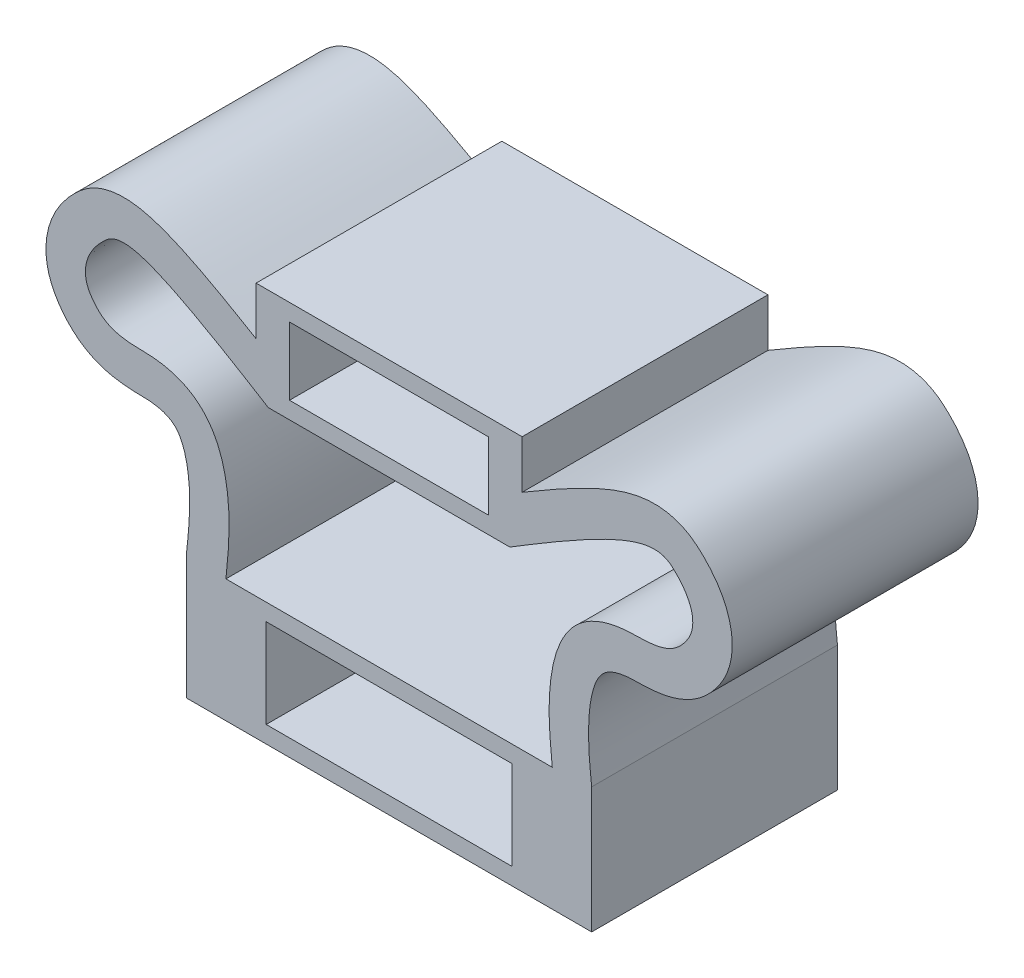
ISO-10303-21;
HEADER;
FILE_DESCRIPTION(('STEP AP214'),'2;1');
FILE_NAME('part.step','',(''),(''),'','','');
FILE_SCHEMA(('AUTOMOTIVE_DESIGN { 1 0 10303 214 1 1 1 1 }'));
ENDSEC;
DATA;
#1=APPLICATION_CONTEXT('core data for automotive mechanical design processes');
#2=APPLICATION_PROTOCOL_DEFINITION('international standard','automotive_design',2000,#1);
#3=PRODUCT_CONTEXT('',#1,'mechanical');
#4=PRODUCT('Part','Part','',(#3));
#5=PRODUCT_RELATED_PRODUCT_CATEGORY('part','',(#4));
#6=PRODUCT_DEFINITION_FORMATION('','',#4);
#7=PRODUCT_DEFINITION_CONTEXT('part definition',#1,'design');
#8=PRODUCT_DEFINITION('design','',#6,#7);
#9=PRODUCT_DEFINITION_SHAPE('','',#8);
#10=(LENGTH_UNIT() NAMED_UNIT(*) SI_UNIT(.MILLI.,.METRE.));
#11=(NAMED_UNIT(*) PLANE_ANGLE_UNIT() SI_UNIT($,.RADIAN.));
#12=(NAMED_UNIT(*) SI_UNIT($,.STERADIAN.) SOLID_ANGLE_UNIT());
#13=UNCERTAINTY_MEASURE_WITH_UNIT(LENGTH_MEASURE(1.E-05),#10,'distance_accuracy_value','');
#14=(GEOMETRIC_REPRESENTATION_CONTEXT(3) GLOBAL_UNCERTAINTY_ASSIGNED_CONTEXT((#13)) GLOBAL_UNIT_ASSIGNED_CONTEXT((#10,
#11,#12)) REPRESENTATION_CONTEXT('',''));
#15=CARTESIAN_POINT('',(0.,0.,0.));
#16=DIRECTION('',(0.,0.,1.));
#17=DIRECTION('',(1.,0.,0.));
#18=AXIS2_PLACEMENT_3D('',#15,#16,#17);
#19=CARTESIAN_POINT('',(0.,0.,5.8));
#20=CARTESIAN_POINT('',(0.0353205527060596,0.35634678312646,5.8));
#21=CARTESIAN_POINT('',(0.0706411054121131,0.712693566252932,5.8));
#22=CARTESIAN_POINT('',(0.0745445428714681,1.07037055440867,5.8));
#23=CARTESIAN_POINT('',(0.0773017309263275,1.32301523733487,5.8));
#24=CARTESIAN_POINT('',(0.0643840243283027,1.57632359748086,5.8));
#25=CARTESIAN_POINT('',(0.0297338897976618,1.82693083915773,5.8));
#26=CARTESIAN_POINT('',(0.0042790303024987,2.01103321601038,5.8));
#27=CARTESIAN_POINT('',(-0.0329042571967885,2.19367786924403,5.8));
#28=CARTESIAN_POINT('',(-0.0884367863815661,2.37100792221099,5.8));
#29=CARTESIAN_POINT('',(-0.131104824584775,2.50725825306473,5.8));
#30=CARTESIAN_POINT('',(-0.184605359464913,2.64037110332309,5.8));
#31=CARTESIAN_POINT('',(-0.251958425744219,2.76630553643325,5.8));
#32=CARTESIAN_POINT('',(-0.306428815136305,2.86815238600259,5.8));
#33=CARTESIAN_POINT('',(-0.369959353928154,2.96530424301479,5.8));
#34=CARTESIAN_POINT('',(-0.443142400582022,3.05464253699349,5.8));
#35=CARTESIAN_POINT('',(-0.505542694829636,3.13081777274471,5.8));
#36=CARTESIAN_POINT('',(-0.574960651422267,3.20131231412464,5.8));
#37=CARTESIAN_POINT('',(-0.650512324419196,3.26444147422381,5.8));
#38=CARTESIAN_POINT('',(-0.718023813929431,3.32085245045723,5.8));
#39=CARTESIAN_POINT('',(-0.790432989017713,3.37138227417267,5.8));
#40=CARTESIAN_POINT('',(-0.866476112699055,3.41557778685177,5.8));
#41=CARTESIAN_POINT('',(-0.936876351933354,3.45649371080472,5.8));
#42=CARTESIAN_POINT('',(-1.01039122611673,3.49198053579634,5.8));
#43=CARTESIAN_POINT('',(-1.08594585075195,3.52228342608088,5.8));
#44=CARTESIAN_POINT('',(-1.15754458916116,3.55099971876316,5.8));
#45=CARTESIAN_POINT('',(-1.23097507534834,3.57506070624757,5.8));
#46=CARTESIAN_POINT('',(-1.30548854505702,3.59495506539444,5.8));
#47=CARTESIAN_POINT('',(-1.37708013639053,3.61406931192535,5.8));
#48=CARTESIAN_POINT('',(-1.44967144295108,3.62933729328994,5.8));
#49=CARTESIAN_POINT('',(-1.52278707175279,3.64131815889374,5.8));
#50=CARTESIAN_POINT('',(-1.59355813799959,3.65291484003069,5.8));
#51=CARTESIAN_POINT('',(-1.66482043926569,3.66143183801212,5.8));
#52=CARTESIAN_POINT('',(-1.73628895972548,3.66719794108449,5.8));
#53=CARTESIAN_POINT('',(-1.80571405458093,3.67279917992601,5.8));
#54=CARTESIAN_POINT('',(-1.87533374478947,3.67580458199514,5.8));
#55=CARTESIAN_POINT('',(-1.94497243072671,3.67704282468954,5.8));
#56=CARTESIAN_POINT('',(-2.00941565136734,3.67818868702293,5.8));
#57=CARTESIAN_POINT('',(-2.07387513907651,3.67782123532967,5.8));
#58=CARTESIAN_POINT('',(-2.13828016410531,3.67992408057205,5.8));
#59=CARTESIAN_POINT('',(-2.1915749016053,3.68166417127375,5.8));
#60=CARTESIAN_POINT('',(-2.24483234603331,3.68509578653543,5.8));
#61=CARTESIAN_POINT('',(-2.29792731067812,3.69021768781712,5.8));
#62=CARTESIAN_POINT('',(-2.34282635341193,3.6945489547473,5.8));
#63=CARTESIAN_POINT('',(-2.38760920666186,3.70008894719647,5.8));
#64=CARTESIAN_POINT('',(-2.4321153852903,3.7074010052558,5.8));
#65=CARTESIAN_POINT('',(-2.47078211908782,3.71375368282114,5.8));
#66=CARTESIAN_POINT('',(-2.50924001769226,3.72144392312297,5.8));
#67=CARTESIAN_POINT('',(-2.54729582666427,3.73080339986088,5.8));
#68=CARTESIAN_POINT('',(-2.58126827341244,3.73915861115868,5.8));
#69=CARTESIAN_POINT('',(-2.61492028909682,3.74884406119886,5.8));
#70=CARTESIAN_POINT('',(-2.64804112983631,3.76011423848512,5.8));
#71=CARTESIAN_POINT('',(-2.67844623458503,3.77046032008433,5.8));
#72=CARTESIAN_POINT('',(-2.708403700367,3.78214190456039,5.8));
#73=CARTESIAN_POINT('',(-2.7377071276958,3.79529157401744,5.8));
#74=CARTESIAN_POINT('',(-2.76539375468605,3.80771571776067,5.8));
#75=CARTESIAN_POINT('',(-2.79249652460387,3.82145041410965,5.8));
#76=CARTESIAN_POINT('',(-2.81883987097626,3.83651537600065,5.8));
#77=CARTESIAN_POINT('',(-2.8444635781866,3.85116879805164,5.8));
#78=CARTESIAN_POINT('',(-2.86936878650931,3.86708079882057,5.8));
#79=CARTESIAN_POINT('',(-2.89343697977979,3.88416922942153,5.8));
#80=CARTESIAN_POINT('',(-2.91752016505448,3.90126830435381,5.8));
#81=CARTESIAN_POINT('',(-2.94076529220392,3.91954527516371,5.8));
#82=CARTESIAN_POINT('',(-2.9631231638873,3.93884297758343,5.8));
#83=CARTESIAN_POINT('',(-2.98609688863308,3.95867223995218,5.8));
#84=CARTESIAN_POINT('',(-3.00813380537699,3.97957924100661,5.8));
#85=CARTESIAN_POINT('',(-3.02927413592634,4.00135370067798,5.8));
#86=CARTESIAN_POINT('',(-3.05152602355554,4.02427305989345,5.8));
#87=CARTESIAN_POINT('',(-3.07278456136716,4.04815349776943,5.8));
#88=CARTESIAN_POINT('',(-3.09310972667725,4.07278587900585,5.8));
#89=CARTESIAN_POINT('',(-3.11496613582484,4.09927399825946,5.8));
#90=CARTESIAN_POINT('',(-3.13574323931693,4.12663162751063,5.8));
#91=CARTESIAN_POINT('',(-3.15576988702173,4.15455479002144,5.8));
#92=CARTESIAN_POINT('',(-3.17738815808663,4.18469715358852,5.8));
#93=CARTESIAN_POINT('',(-3.19813194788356,4.21549851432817,5.8));
#94=CARTESIAN_POINT('',(-3.21655573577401,4.24767523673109,5.8));
#95=CARTESIAN_POINT('',(-3.23503031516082,4.27994066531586,5.8));
#96=CARTESIAN_POINT('',(-3.25117208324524,4.3135890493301,5.8));
#97=CARTESIAN_POINT('',(-3.26473821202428,4.34823896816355,5.8));
#98=CARTESIAN_POINT('',(-3.27827211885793,4.38280658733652,5.8));
#99=CARTESIAN_POINT('',(-3.28924260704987,4.41837098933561,5.8));
#100=CARTESIAN_POINT('',(-3.29745517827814,4.45456496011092,5.8));
#101=CARTESIAN_POINT('',(-3.30573290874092,4.49104609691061,5.8));
#102=CARTESIAN_POINT('',(-3.31120878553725,4.5281668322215,5.8));
#103=CARTESIAN_POINT('',(-3.31389957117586,4.56548094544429,5.8));
#104=CARTESIAN_POINT('',(-3.31663980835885,4.60348082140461,5.8));
#105=CARTESIAN_POINT('',(-3.31649164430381,4.64168124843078,5.8));
#106=CARTESIAN_POINT('',(-3.31364776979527,4.67966975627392,5.8));
#107=CARTESIAN_POINT('',(-3.31072682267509,4.7186878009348,5.8));
#108=CARTESIAN_POINT('',(-3.30496207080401,4.75748228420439,5.8));
#109=CARTESIAN_POINT('',(-3.29668566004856,4.79572046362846,5.8));
#110=CARTESIAN_POINT('',(-3.2881381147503,4.83521132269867,5.8));
#111=CARTESIAN_POINT('',(-3.27691165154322,4.87410883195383,5.8));
#112=CARTESIAN_POINT('',(-3.26340991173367,4.91218601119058,5.8));
#113=CARTESIAN_POINT('',(-3.24943752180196,4.95159050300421,5.8));
#114=CARTESIAN_POINT('',(-3.233028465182,4.9901164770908,5.8));
#115=CARTESIAN_POINT('',(-3.21460430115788,5.02764245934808,5.8));
#116=CARTESIAN_POINT('',(-3.19555997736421,5.06643157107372,5.8));
#117=CARTESIAN_POINT('',(-3.17436260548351,5.10415223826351,5.8));
#118=CARTESIAN_POINT('',(-3.1513936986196,5.14074484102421,5.8));
#119=CARTESIAN_POINT('',(-3.12773889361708,5.1784301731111,5.8));
#120=CARTESIAN_POINT('',(-3.10220517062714,5.2149190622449,5.8));
#121=CARTESIAN_POINT('',(-3.0751806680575,5.25027522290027,5.8));
#122=CARTESIAN_POINT('',(-3.04750005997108,5.28648976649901,5.8));
#123=CARTESIAN_POINT('',(-3.01825540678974,5.32151591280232,5.8));
#124=CARTESIAN_POINT('',(-2.9875711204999,5.35517972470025,5.8));
#125=CARTESIAN_POINT('',(-2.95634543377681,5.38943750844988,5.8));
#126=CARTESIAN_POINT('',(-2.9236288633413,5.42228445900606,5.8));
#127=CARTESIAN_POINT('',(-2.89029594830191,5.45459273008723,5.8));
#128=CARTESIAN_POINT('',(-2.85671616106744,5.48714028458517,5.8));
#129=CARTESIAN_POINT('',(-2.82251086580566,5.5191411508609,5.8));
#130=CARTESIAN_POINT('',(-2.78495026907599,5.54697946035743,5.8));
#131=CARTESIAN_POINT('',(-2.7488752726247,5.57371670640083,5.8));
#132=CARTESIAN_POINT('',(-2.70970514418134,5.59661415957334,5.8));
#133=CARTESIAN_POINT('',(-2.6682878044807,5.61406558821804,5.8));
#134=CARTESIAN_POINT('',(-2.62624749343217,5.63177950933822,5.8));
#135=CARTESIAN_POINT('',(-2.58189186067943,5.64388234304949,5.8));
#136=CARTESIAN_POINT('',(-2.53688099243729,5.65137300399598,5.8));
#137=CARTESIAN_POINT('',(-2.48773872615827,5.65955120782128,5.8));
#138=CARTESIAN_POINT('',(-2.43781542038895,5.66223171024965,5.8));
#139=CARTESIAN_POINT('',(-2.38805783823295,5.66106164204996,5.8));
#140=CARTESIAN_POINT('',(-2.33115524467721,5.65972355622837,5.8));
#141=CARTESIAN_POINT('',(-2.27446938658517,5.65334964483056,5.8));
#142=CARTESIAN_POINT('',(-2.21837711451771,5.64382542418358,5.8));
#143=CARTESIAN_POINT('',(-2.15256589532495,5.63265096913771,5.8));
#144=CARTESIAN_POINT('',(-2.08757178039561,5.61713993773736,5.8));
#145=CARTESIAN_POINT('',(-2.0233591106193,5.598991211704,5.8));
#146=CARTESIAN_POINT('',(-1.94690937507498,5.57738386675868,5.8));
#147=CARTESIAN_POINT('',(-1.87156730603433,5.55203769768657,5.8));
#148=CARTESIAN_POINT('',(-1.79708437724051,5.52444040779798,5.8));
#149=CARTESIAN_POINT('',(-1.70746120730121,5.49123338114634,5.8));
#150=CARTESIAN_POINT('',(-1.61908195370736,5.45476704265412,5.8));
#151=CARTESIAN_POINT('',(-1.53158291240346,5.41633479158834,5.8));
#152=CARTESIAN_POINT('',(-1.4251885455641,5.36960313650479,5.8));
#153=CARTESIAN_POINT('',(-1.32009560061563,5.31996481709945,5.8));
#154=CARTESIAN_POINT('',(-1.21587727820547,5.26857646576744,5.8));
#155=CARTESIAN_POINT('',(-1.08755540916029,5.20530304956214,5.8));
#156=CARTESIAN_POINT('',(-0.960559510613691,5.13937649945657,5.8));
#157=CARTESIAN_POINT('',(-0.834429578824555,5.07184953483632,5.8));
#158=CARTESIAN_POINT('',(-0.676613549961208,4.98735858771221,5.8));
#159=CARTESIAN_POINT('',(-0.520153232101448,4.90036211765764,5.8));
#160=CARTESIAN_POINT('',(-0.364510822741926,4.81193420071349,5.8));
#161=CARTESIAN_POINT('',(-0.165627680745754,4.69893914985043,5.8));
#162=CARTESIAN_POINT('',(0.0319199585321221,4.58360679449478,5.8));
#163=CARTESIAN_POINT('',(0.228492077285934,4.46664959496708,5.8));
#164=CARTESIAN_POINT('',(0.486784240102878,4.31296997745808,5.8));
#165=CARTESIAN_POINT('',(0.743392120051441,4.15648498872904,5.8));
#166=CARTESIAN_POINT('',(1.,4.,5.8));
#167=B_SPLINE_CURVE_WITH_KNOTS('',3,(#19,#20,#21,#22,#23,#24,#25,#26,#27,#28,#29,#30,#31,#32,
#33,#34,#35,#36,#37,#38,#39,#40,#41,#42,#43,#44,#45,#46,#47,#48,#49,#50,#51,#52,#53,#54,#55,#56,
#57,#58,#59,#60,#61,#62,#63,#64,#65,#66,#67,#68,#69,#70,#71,#72,#73,#74,#75,#76,#77,#78,#79,#80,
#81,#82,#83,#84,#85,#86,#87,#88,#89,#90,#91,#92,#93,#94,#95,#96,#97,#98,#99,#100,#101,#102,#103,
#104,#105,#106,#107,#108,#109,#110,#111,#112,#113,#114,#115,#116,#117,#118,#119,#120,#121,#122,
#123,#124,#125,#126,#127,#128,#129,#130,#131,#132,#133,#134,#135,#136,#137,#138,#139,#140,#141,
#142,#143,#144,#145,#146,#147,#148,#149,#150,#151,#152,#153,#154,#155,#156,#157,#158,#159,#160,
#161,#162,#163,#164,#165,#166),.UNSPECIFIED.,.F.,.F.,(4,3,3,3,3,3,3,3,3,3,3,3,3,3,3,3,3,3,3,3,3,
3,3,3,3,3,3,3,3,3,3,3,3,3,3,3,3,3,3,3,3,3,3,3,3,3,3,3,3,4),(0.,1.07296319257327,
1.83084937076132,2.38761160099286,2.81539604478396,3.16135780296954,3.45634573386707,
3.71994114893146,3.96397610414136,4.19523388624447,4.41742341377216,4.63248810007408,
4.84140366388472,5.03473286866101,5.19471152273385,5.32999531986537,5.44752917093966,
5.55245172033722,5.648771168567,5.73977624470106,5.82829527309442,5.91686943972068,
6.00788340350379,6.10368287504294,6.20669962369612,6.31790365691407,6.42941426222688,
6.54066001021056,6.65278839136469,6.7669774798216,6.88426123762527,7.0053872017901,
7.13073543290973,7.26030290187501,7.39373951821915,7.53041573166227,7.66950349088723,
7.80962137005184,7.94419729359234,8.08079741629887,8.22993561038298,8.40048951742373,
8.60059481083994,8.83883434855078,9.12550114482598,9.47407333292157,9.9032630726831,
10.4402729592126,11.126475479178,12.0281330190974),.UNSPECIFIED.);
#168=DIRECTION('',(0.,0.,-1.));
#169=VECTOR('',#168,1.);
#170=SURFACE_OF_LINEAR_EXTRUSION('',#167,#169);
#171=CARTESIAN_POINT('',(0.,0.,0.));
#172=CARTESIAN_POINT('',(0.0353205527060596,0.35634678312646,0.));
#173=CARTESIAN_POINT('',(0.0706411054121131,0.712693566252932,0.));
#174=CARTESIAN_POINT('',(0.0745445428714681,1.07037055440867,0.));
#175=CARTESIAN_POINT('',(0.0773017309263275,1.32301523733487,0.));
#176=CARTESIAN_POINT('',(0.0643840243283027,1.57632359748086,0.));
#177=CARTESIAN_POINT('',(0.0297338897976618,1.82693083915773,0.));
#178=CARTESIAN_POINT('',(0.0042790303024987,2.01103321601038,0.));
#179=CARTESIAN_POINT('',(-0.0329042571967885,2.19367786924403,0.));
#180=CARTESIAN_POINT('',(-0.0884367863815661,2.37100792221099,0.));
#181=CARTESIAN_POINT('',(-0.131104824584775,2.50725825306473,0.));
#182=CARTESIAN_POINT('',(-0.184605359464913,2.64037110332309,0.));
#183=CARTESIAN_POINT('',(-0.251958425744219,2.76630553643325,0.));
#184=CARTESIAN_POINT('',(-0.306428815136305,2.86815238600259,0.));
#185=CARTESIAN_POINT('',(-0.369959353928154,2.96530424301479,0.));
#186=CARTESIAN_POINT('',(-0.443142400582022,3.05464253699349,0.));
#187=CARTESIAN_POINT('',(-0.505542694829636,3.13081777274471,0.));
#188=CARTESIAN_POINT('',(-0.574960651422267,3.20131231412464,0.));
#189=CARTESIAN_POINT('',(-0.650512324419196,3.26444147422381,0.));
#190=CARTESIAN_POINT('',(-0.718023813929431,3.32085245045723,0.));
#191=CARTESIAN_POINT('',(-0.790432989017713,3.37138227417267,0.));
#192=CARTESIAN_POINT('',(-0.866476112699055,3.41557778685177,0.));
#193=CARTESIAN_POINT('',(-0.936876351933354,3.45649371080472,0.));
#194=CARTESIAN_POINT('',(-1.01039122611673,3.49198053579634,0.));
#195=CARTESIAN_POINT('',(-1.08594585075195,3.52228342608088,0.));
#196=CARTESIAN_POINT('',(-1.15754458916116,3.55099971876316,0.));
#197=CARTESIAN_POINT('',(-1.23097507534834,3.57506070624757,0.));
#198=CARTESIAN_POINT('',(-1.30548854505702,3.59495506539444,0.));
#199=CARTESIAN_POINT('',(-1.37708013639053,3.61406931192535,0.));
#200=CARTESIAN_POINT('',(-1.44967144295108,3.62933729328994,0.));
#201=CARTESIAN_POINT('',(-1.52278707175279,3.64131815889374,0.));
#202=CARTESIAN_POINT('',(-1.59355813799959,3.65291484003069,0.));
#203=CARTESIAN_POINT('',(-1.66482043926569,3.66143183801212,0.));
#204=CARTESIAN_POINT('',(-1.73628895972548,3.66719794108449,0.));
#205=CARTESIAN_POINT('',(-1.80571405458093,3.67279917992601,0.));
#206=CARTESIAN_POINT('',(-1.87533374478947,3.67580458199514,0.));
#207=CARTESIAN_POINT('',(-1.94497243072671,3.67704282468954,0.));
#208=CARTESIAN_POINT('',(-2.00941565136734,3.67818868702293,0.));
#209=CARTESIAN_POINT('',(-2.07387513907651,3.67782123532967,0.));
#210=CARTESIAN_POINT('',(-2.13828016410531,3.67992408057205,0.));
#211=CARTESIAN_POINT('',(-2.1915749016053,3.68166417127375,0.));
#212=CARTESIAN_POINT('',(-2.24483234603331,3.68509578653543,0.));
#213=CARTESIAN_POINT('',(-2.29792731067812,3.69021768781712,0.));
#214=CARTESIAN_POINT('',(-2.34282635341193,3.6945489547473,0.));
#215=CARTESIAN_POINT('',(-2.38760920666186,3.70008894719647,0.));
#216=CARTESIAN_POINT('',(-2.4321153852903,3.7074010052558,0.));
#217=CARTESIAN_POINT('',(-2.47078211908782,3.71375368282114,0.));
#218=CARTESIAN_POINT('',(-2.50924001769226,3.72144392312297,0.));
#219=CARTESIAN_POINT('',(-2.54729582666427,3.73080339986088,0.));
#220=CARTESIAN_POINT('',(-2.58126827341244,3.73915861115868,0.));
#221=CARTESIAN_POINT('',(-2.61492028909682,3.74884406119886,0.));
#222=CARTESIAN_POINT('',(-2.64804112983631,3.76011423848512,0.));
#223=CARTESIAN_POINT('',(-2.67844623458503,3.77046032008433,0.));
#224=CARTESIAN_POINT('',(-2.708403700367,3.78214190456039,0.));
#225=CARTESIAN_POINT('',(-2.7377071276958,3.79529157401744,0.));
#226=CARTESIAN_POINT('',(-2.76539375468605,3.80771571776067,0.));
#227=CARTESIAN_POINT('',(-2.79249652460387,3.82145041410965,0.));
#228=CARTESIAN_POINT('',(-2.81883987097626,3.83651537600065,0.));
#229=CARTESIAN_POINT('',(-2.8444635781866,3.85116879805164,0.));
#230=CARTESIAN_POINT('',(-2.86936878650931,3.86708079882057,0.));
#231=CARTESIAN_POINT('',(-2.89343697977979,3.88416922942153,0.));
#232=CARTESIAN_POINT('',(-2.91752016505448,3.90126830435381,0.));
#233=CARTESIAN_POINT('',(-2.94076529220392,3.91954527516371,0.));
#234=CARTESIAN_POINT('',(-2.9631231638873,3.93884297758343,0.));
#235=CARTESIAN_POINT('',(-2.98609688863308,3.95867223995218,0.));
#236=CARTESIAN_POINT('',(-3.00813380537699,3.97957924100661,0.));
#237=CARTESIAN_POINT('',(-3.02927413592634,4.00135370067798,0.));
#238=CARTESIAN_POINT('',(-3.05152602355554,4.02427305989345,0.));
#239=CARTESIAN_POINT('',(-3.07278456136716,4.04815349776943,0.));
#240=CARTESIAN_POINT('',(-3.09310972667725,4.07278587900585,0.));
#241=CARTESIAN_POINT('',(-3.11496613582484,4.09927399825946,0.));
#242=CARTESIAN_POINT('',(-3.13574323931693,4.12663162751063,0.));
#243=CARTESIAN_POINT('',(-3.15576988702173,4.15455479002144,0.));
#244=CARTESIAN_POINT('',(-3.17738815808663,4.18469715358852,0.));
#245=CARTESIAN_POINT('',(-3.19813194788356,4.21549851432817,0.));
#246=CARTESIAN_POINT('',(-3.21655573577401,4.24767523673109,0.));
#247=CARTESIAN_POINT('',(-3.23503031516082,4.27994066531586,0.));
#248=CARTESIAN_POINT('',(-3.25117208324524,4.3135890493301,0.));
#249=CARTESIAN_POINT('',(-3.26473821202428,4.34823896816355,0.));
#250=CARTESIAN_POINT('',(-3.27827211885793,4.38280658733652,0.));
#251=CARTESIAN_POINT('',(-3.28924260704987,4.41837098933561,0.));
#252=CARTESIAN_POINT('',(-3.29745517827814,4.45456496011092,0.));
#253=CARTESIAN_POINT('',(-3.30573290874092,4.49104609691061,0.));
#254=CARTESIAN_POINT('',(-3.31120878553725,4.5281668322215,0.));
#255=CARTESIAN_POINT('',(-3.31389957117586,4.56548094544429,0.));
#256=CARTESIAN_POINT('',(-3.31663980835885,4.60348082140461,0.));
#257=CARTESIAN_POINT('',(-3.31649164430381,4.64168124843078,0.));
#258=CARTESIAN_POINT('',(-3.31364776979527,4.67966975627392,0.));
#259=CARTESIAN_POINT('',(-3.31072682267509,4.7186878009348,0.));
#260=CARTESIAN_POINT('',(-3.30496207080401,4.75748228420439,0.));
#261=CARTESIAN_POINT('',(-3.29668566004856,4.79572046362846,0.));
#262=CARTESIAN_POINT('',(-3.2881381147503,4.83521132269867,0.));
#263=CARTESIAN_POINT('',(-3.27691165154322,4.87410883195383,0.));
#264=CARTESIAN_POINT('',(-3.26340991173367,4.91218601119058,0.));
#265=CARTESIAN_POINT('',(-3.24943752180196,4.95159050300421,0.));
#266=CARTESIAN_POINT('',(-3.233028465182,4.9901164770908,0.));
#267=CARTESIAN_POINT('',(-3.21460430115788,5.02764245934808,0.));
#268=CARTESIAN_POINT('',(-3.19555997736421,5.06643157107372,0.));
#269=CARTESIAN_POINT('',(-3.17436260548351,5.10415223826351,0.));
#270=CARTESIAN_POINT('',(-3.1513936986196,5.14074484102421,0.));
#271=CARTESIAN_POINT('',(-3.12773889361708,5.1784301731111,0.));
#272=CARTESIAN_POINT('',(-3.10220517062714,5.2149190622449,0.));
#273=CARTESIAN_POINT('',(-3.0751806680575,5.25027522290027,0.));
#274=CARTESIAN_POINT('',(-3.04750005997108,5.28648976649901,0.));
#275=CARTESIAN_POINT('',(-3.01825540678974,5.32151591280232,0.));
#276=CARTESIAN_POINT('',(-2.9875711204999,5.35517972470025,0.));
#277=CARTESIAN_POINT('',(-2.95634543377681,5.38943750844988,0.));
#278=CARTESIAN_POINT('',(-2.9236288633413,5.42228445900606,0.));
#279=CARTESIAN_POINT('',(-2.89029594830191,5.45459273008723,0.));
#280=CARTESIAN_POINT('',(-2.85671616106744,5.48714028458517,0.));
#281=CARTESIAN_POINT('',(-2.82251086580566,5.5191411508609,0.));
#282=CARTESIAN_POINT('',(-2.78495026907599,5.54697946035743,0.));
#283=CARTESIAN_POINT('',(-2.7488752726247,5.57371670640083,0.));
#284=CARTESIAN_POINT('',(-2.70970514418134,5.59661415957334,0.));
#285=CARTESIAN_POINT('',(-2.6682878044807,5.61406558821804,0.));
#286=CARTESIAN_POINT('',(-2.62624749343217,5.63177950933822,0.));
#287=CARTESIAN_POINT('',(-2.58189186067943,5.64388234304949,0.));
#288=CARTESIAN_POINT('',(-2.53688099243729,5.65137300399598,0.));
#289=CARTESIAN_POINT('',(-2.48773872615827,5.65955120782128,0.));
#290=CARTESIAN_POINT('',(-2.43781542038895,5.66223171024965,0.));
#291=CARTESIAN_POINT('',(-2.38805783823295,5.66106164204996,0.));
#292=CARTESIAN_POINT('',(-2.33115524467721,5.65972355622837,0.));
#293=CARTESIAN_POINT('',(-2.27446938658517,5.65334964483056,0.));
#294=CARTESIAN_POINT('',(-2.21837711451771,5.64382542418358,0.));
#295=CARTESIAN_POINT('',(-2.15256589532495,5.63265096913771,0.));
#296=CARTESIAN_POINT('',(-2.08757178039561,5.61713993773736,0.));
#297=CARTESIAN_POINT('',(-2.0233591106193,5.598991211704,0.));
#298=CARTESIAN_POINT('',(-1.94690937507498,5.57738386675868,0.));
#299=CARTESIAN_POINT('',(-1.87156730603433,5.55203769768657,0.));
#300=CARTESIAN_POINT('',(-1.79708437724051,5.52444040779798,0.));
#301=CARTESIAN_POINT('',(-1.70746120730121,5.49123338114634,0.));
#302=CARTESIAN_POINT('',(-1.61908195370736,5.45476704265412,0.));
#303=CARTESIAN_POINT('',(-1.53158291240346,5.41633479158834,0.));
#304=CARTESIAN_POINT('',(-1.4251885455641,5.36960313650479,0.));
#305=CARTESIAN_POINT('',(-1.32009560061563,5.31996481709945,0.));
#306=CARTESIAN_POINT('',(-1.21587727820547,5.26857646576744,0.));
#307=CARTESIAN_POINT('',(-1.08755540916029,5.20530304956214,0.));
#308=CARTESIAN_POINT('',(-0.960559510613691,5.13937649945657,0.));
#309=CARTESIAN_POINT('',(-0.834429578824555,5.07184953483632,0.));
#310=CARTESIAN_POINT('',(-0.676613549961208,4.98735858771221,0.));
#311=CARTESIAN_POINT('',(-0.520153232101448,4.90036211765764,0.));
#312=CARTESIAN_POINT('',(-0.364510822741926,4.81193420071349,0.));
#313=CARTESIAN_POINT('',(-0.165627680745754,4.69893914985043,0.));
#314=CARTESIAN_POINT('',(0.0319199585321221,4.58360679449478,0.));
#315=CARTESIAN_POINT('',(0.228492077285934,4.46664959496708,0.));
#316=CARTESIAN_POINT('',(0.486784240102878,4.31296997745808,0.));
#317=CARTESIAN_POINT('',(0.743392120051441,4.15648498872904,0.));
#318=CARTESIAN_POINT('',(1.,4.,0.));
#319=B_SPLINE_CURVE_WITH_KNOTS('',3,(#171,#172,#173,#174,#175,#176,#177,#178,#179,#180,#181,
#182,#183,#184,#185,#186,#187,#188,#189,#190,#191,#192,#193,#194,#195,#196,#197,#198,#199,#200,
#201,#202,#203,#204,#205,#206,#207,#208,#209,#210,#211,#212,#213,#214,#215,#216,#217,#218,#219,
#220,#221,#222,#223,#224,#225,#226,#227,#228,#229,#230,#231,#232,#233,#234,#235,#236,#237,#238,
#239,#240,#241,#242,#243,#244,#245,#246,#247,#248,#249,#250,#251,#252,#253,#254,#255,#256,#257,
#258,#259,#260,#261,#262,#263,#264,#265,#266,#267,#268,#269,#270,#271,#272,#273,#274,#275,#276,
#277,#278,#279,#280,#281,#282,#283,#284,#285,#286,#287,#288,#289,#290,#291,#292,#293,#294,#295,
#296,#297,#298,#299,#300,#301,#302,#303,#304,#305,#306,#307,#308,#309,#310,#311,#312,#313,#314,
#315,#316,#317,#318),.UNSPECIFIED.,.F.,.F.,(4,3,3,3,3,3,3,3,3,3,3,3,3,3,3,3,3,3,3,3,3,3,3,3,3,3,
3,3,3,3,3,3,3,3,3,3,3,3,3,3,3,3,3,3,3,3,3,3,3,4),(0.,1.07296319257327,1.83084937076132,
2.38761160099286,2.81539604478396,3.16135780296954,3.45634573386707,3.71994114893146,
3.96397610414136,4.19523388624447,4.41742341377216,4.63248810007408,4.84140366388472,
5.03473286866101,5.19471152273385,5.32999531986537,5.44752917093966,5.55245172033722,
5.648771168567,5.73977624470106,5.82829527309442,5.91686943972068,6.00788340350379,
6.10368287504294,6.20669962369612,6.31790365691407,6.42941426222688,6.54066001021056,
6.65278839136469,6.7669774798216,6.88426123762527,7.0053872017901,7.13073543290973,
7.26030290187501,7.39373951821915,7.53041573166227,7.66950349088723,7.80962137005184,
7.94419729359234,8.08079741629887,8.22993561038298,8.40048951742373,8.60059481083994,
8.83883434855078,9.12550114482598,9.47407333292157,9.9032630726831,10.4402729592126,
11.126475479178,12.0281330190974),.UNSPECIFIED.);
#320=CARTESIAN_POINT('',(0.,0.,0.));
#321=VERTEX_POINT('',#320);
#322=CARTESIAN_POINT('',(1.,4.,0.));
#323=VERTEX_POINT('',#322);
#324=EDGE_CURVE('E159',#321,#323,#319,.T.);
#325=ORIENTED_EDGE('',*,*,#324,.T.);
#326=DIRECTION('',(0.,0.,-1.));
#327=VECTOR('',#326,1.);
#328=CARTESIAN_POINT('',(1.,4.,5.8));
#329=LINE('',#328,#327);
#330=CARTESIAN_POINT('',(1.,4.,5.8));
#331=VERTEX_POINT('',#330);
#332=EDGE_CURVE('E11',#331,#323,#329,.T.);
#333=ORIENTED_EDGE('',*,*,#332,.F.);
#334=CARTESIAN_POINT('',(0.,0.,5.8));
#335=VERTEX_POINT('',#334);
#336=EDGE_CURVE('E200',#335,#331,#167,.T.);
#337=ORIENTED_EDGE('',*,*,#336,.F.);
#338=DIRECTION('',(0.,0.,-1.));
#339=VECTOR('',#338,1.);
#340=CARTESIAN_POINT('',(0.,0.,5.8));
#341=LINE('',#340,#339);
#342=EDGE_CURVE('E158',#335,#321,#341,.T.);
#343=ORIENTED_EDGE('',*,*,#342,.T.);
#344=EDGE_LOOP('',(#325,#333,#337,#343));
#345=FACE_BOUND('',#344,.T.);
#346=ADVANCED_FACE('F34',(#345),#170,.F.);
#347=CARTESIAN_POINT('',(1.,4.,5.8));
#348=DIRECTION('',(0.,1.,0.));
#349=DIRECTION('',(0.,0.,1.));
#350=AXIS2_PLACEMENT_3D('',#347,#348,#349);
#351=PLANE('',#350);
#352=DIRECTION('',(1.,0.,0.));
#353=VECTOR('',#352,1.);
#354=CARTESIAN_POINT('',(1.,4.,0.));
#355=LINE('',#354,#353);
#356=CARTESIAN_POINT('',(6.7,4.,0.));
#357=VERTEX_POINT('',#356);
#358=EDGE_CURVE('E164',#323,#357,#355,.T.);
#359=ORIENTED_EDGE('',*,*,#358,.T.);
#360=DIRECTION('',(0.,0.,-1.));
#361=VECTOR('',#360,1.);
#362=CARTESIAN_POINT('',(6.7,4.,5.8));
#363=LINE('',#362,#361);
#364=CARTESIAN_POINT('',(6.7,4.,5.8));
#365=VERTEX_POINT('',#364);
#366=EDGE_CURVE('E257',#365,#357,#363,.T.);
#367=ORIENTED_EDGE('',*,*,#366,.F.);
#368=DIRECTION('',(1.,0.,0.));
#369=VECTOR('',#368,1.);
#370=CARTESIAN_POINT('',(1.,4.,5.8));
#371=LINE('',#370,#369);
#372=EDGE_CURVE('E103',#331,#365,#371,.T.);
#373=ORIENTED_EDGE('',*,*,#372,.F.);
#374=ORIENTED_EDGE('',*,*,#332,.T.);
#375=EDGE_LOOP('',(#359,#367,#373,#374));
#376=FACE_BOUND('',#375,.T.);
#377=ADVANCED_FACE('F323',(#376),#351,.F.);
#378=CARTESIAN_POINT('',(3.85,4.4,5.8));
#379=DIRECTION('',(0.,-1.,0.));
#380=DIRECTION('',(0.,0.,-1.));
#381=AXIS2_PLACEMENT_3D('',#378,#379,#380);
#382=PLANE('',#381);
#383=DIRECTION('',(-1.,0.,0.));
#384=VECTOR('',#383,1.);
#385=CARTESIAN_POINT('',(3.85,4.4,0.));
#386=LINE('',#385,#384);
#387=CARTESIAN_POINT('',(6.2,4.4,0.));
#388=VERTEX_POINT('',#387);
#389=CARTESIAN_POINT('',(1.5,4.4,0.));
#390=VERTEX_POINT('',#389);
#391=EDGE_CURVE('E171',#388,#390,#386,.T.);
#392=ORIENTED_EDGE('',*,*,#391,.T.);
#393=DIRECTION('',(0.,0.,-1.));
#394=VECTOR('',#393,1.);
#395=CARTESIAN_POINT('',(1.5,4.4,5.8));
#396=LINE('',#395,#394);
#397=CARTESIAN_POINT('',(1.5,4.4,5.8));
#398=VERTEX_POINT('',#397);
#399=EDGE_CURVE('E43',#398,#390,#396,.T.);
#400=ORIENTED_EDGE('',*,*,#399,.F.);
#401=DIRECTION('',(-1.,0.,0.));
#402=VECTOR('',#401,1.);
#403=CARTESIAN_POINT('',(3.85,4.4,5.8));
#404=LINE('',#403,#402);
#405=CARTESIAN_POINT('',(6.2,4.4,5.8));
#406=VERTEX_POINT('',#405);
#407=EDGE_CURVE('E282',#406,#398,#404,.T.);
#408=ORIENTED_EDGE('',*,*,#407,.F.);
#409=DIRECTION('',(0.,0.,-1.));
#410=VECTOR('',#409,1.);
#411=CARTESIAN_POINT('',(6.2,4.4,5.8));
#412=LINE('',#411,#410);
#413=EDGE_CURVE('E252',#406,#388,#412,.T.);
#414=ORIENTED_EDGE('',*,*,#413,.T.);
#415=EDGE_LOOP('',(#392,#400,#408,#414));
#416=FACE_BOUND('',#415,.T.);
#417=ADVANCED_FACE('F321',(#416),#382,.F.);
#418=CARTESIAN_POINT('',(1.5,4.4,5.8));
#419=DIRECTION('',(-1.,0.,0.));
#420=DIRECTION('',(0.,0.,1.));
#421=AXIS2_PLACEMENT_3D('',#418,#419,#420);
#422=PLANE('',#421);
#423=DIRECTION('',(0.,1.,0.));
#424=VECTOR('',#423,1.);
#425=CARTESIAN_POINT('',(1.5,4.4,0.));
#426=LINE('',#425,#424);
#427=CARTESIAN_POINT('',(1.5,6.,0.));
#428=VERTEX_POINT('',#427);
#429=EDGE_CURVE('E173',#390,#428,#426,.T.);
#430=ORIENTED_EDGE('',*,*,#429,.T.);
#431=DIRECTION('',(0.,0.,-1.));
#432=VECTOR('',#431,1.);
#433=CARTESIAN_POINT('',(1.5,6.,5.8));
#434=LINE('',#433,#432);
#435=CARTESIAN_POINT('',(1.5,6.,5.8));
#436=VERTEX_POINT('',#435);
#437=EDGE_CURVE('E214',#436,#428,#434,.T.);
#438=ORIENTED_EDGE('',*,*,#437,.F.);
#439=DIRECTION('',(0.,1.,0.));
#440=VECTOR('',#439,1.);
#441=CARTESIAN_POINT('',(1.5,4.4,5.8));
#442=LINE('',#441,#440);
#443=EDGE_CURVE('E223',#398,#436,#442,.T.);
#444=ORIENTED_EDGE('',*,*,#443,.F.);
#445=ORIENTED_EDGE('',*,*,#399,.T.);
#446=EDGE_LOOP('',(#430,#438,#444,#445));
#447=FACE_BOUND('',#446,.T.);
#448=ADVANCED_FACE('F221',(#447),#422,.F.);
#449=CARTESIAN_POINT('',(1.5,6.,5.8));
#450=DIRECTION('',(0.,1.,0.));
#451=DIRECTION('',(0.,0.,1.));
#452=AXIS2_PLACEMENT_3D('',#449,#450,#451);
#453=PLANE('',#452);
#454=DIRECTION('',(1.,0.,0.));
#455=VECTOR('',#454,1.);
#456=CARTESIAN_POINT('',(1.5,6.,0.));
#457=LINE('',#456,#455);
#458=CARTESIAN_POINT('',(6.2,6.,0.));
#459=VERTEX_POINT('',#458);
#460=EDGE_CURVE('E175',#428,#459,#457,.T.);
#461=ORIENTED_EDGE('',*,*,#460,.T.);
#462=DIRECTION('',(0.,0.,-1.));
#463=VECTOR('',#462,1.);
#464=CARTESIAN_POINT('',(6.2,6.,5.8));
#465=LINE('',#464,#463);
#466=CARTESIAN_POINT('',(6.2,6.,5.8));
#467=VERTEX_POINT('',#466);
#468=EDGE_CURVE('E242',#467,#459,#465,.T.);
#469=ORIENTED_EDGE('',*,*,#468,.F.);
#470=DIRECTION('',(1.,0.,0.));
#471=VECTOR('',#470,1.);
#472=CARTESIAN_POINT('',(1.5,6.,5.8));
#473=LINE('',#472,#471);
#474=EDGE_CURVE('E285',#436,#467,#473,.T.);
#475=ORIENTED_EDGE('',*,*,#474,.F.);
#476=ORIENTED_EDGE('',*,*,#437,.T.);
#477=EDGE_LOOP('',(#461,#469,#475,#476));
#478=FACE_BOUND('',#477,.T.);
#479=ADVANCED_FACE('F239',(#478),#453,.F.);
#480=CARTESIAN_POINT('',(3.85,6.4,5.8));
#481=DIRECTION('',(0.,-1.,0.));
#482=DIRECTION('',(0.,0.,-1.));
#483=AXIS2_PLACEMENT_3D('',#480,#481,#482);
#484=PLANE('',#483);
#485=DIRECTION('',(-1.,0.,0.));
#486=VECTOR('',#485,1.);
#487=CARTESIAN_POINT('',(3.85,6.4,0.));
#488=LINE('',#487,#486);
#489=CARTESIAN_POINT('',(6.9890211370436,6.4,0.));
#490=VERTEX_POINT('',#489);
#491=CARTESIAN_POINT('',(0.7109788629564,6.4,0.));
#492=VERTEX_POINT('',#491);
#493=EDGE_CURVE('E178',#490,#492,#488,.T.);
#494=ORIENTED_EDGE('',*,*,#493,.T.);
#495=DIRECTION('',(0.,0.,-1.));
#496=VECTOR('',#495,1.);
#497=CARTESIAN_POINT('',(0.7109788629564,6.4,5.8));
#498=LINE('',#497,#496);
#499=CARTESIAN_POINT('',(0.7109788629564,6.4,5.8));
#500=VERTEX_POINT('',#499);
#501=EDGE_CURVE('E211',#500,#492,#498,.T.);
#502=ORIENTED_EDGE('',*,*,#501,.F.);
#503=DIRECTION('',(-1.,0.,0.));
#504=VECTOR('',#503,1.);
#505=CARTESIAN_POINT('',(3.85,6.4,5.8));
#506=LINE('',#505,#504);
#507=CARTESIAN_POINT('',(6.9890211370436,6.4,5.8));
#508=VERTEX_POINT('',#507);
#509=EDGE_CURVE('E288',#508,#500,#506,.T.);
#510=ORIENTED_EDGE('',*,*,#509,.F.);
#511=DIRECTION('',(0.,0.,-1.));
#512=VECTOR('',#511,1.);
#513=CARTESIAN_POINT('',(6.9890211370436,6.4,5.8));
#514=LINE('',#513,#512);
#515=EDGE_CURVE('E251',#508,#490,#514,.T.);
#516=ORIENTED_EDGE('',*,*,#515,.T.);
#517=EDGE_LOOP('',(#494,#502,#510,#516));
#518=FACE_BOUND('',#517,.T.);
#519=ADVANCED_FACE('F312',(#518),#484,.F.);
#520=CARTESIAN_POINT('',(0.7109788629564,6.4,5.8));
#521=DIRECTION('',(1.,0.,0.));
#522=DIRECTION('',(0.,1.,0.));
#523=AXIS2_PLACEMENT_3D('',#520,#521,#522);
#524=PLANE('',#523);
#525=DIRECTION('',(0.,-1.,0.));
#526=VECTOR('',#525,1.);
#527=CARTESIAN_POINT('',(0.7109788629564,6.4,0.));
#528=LINE('',#527,#526);
#529=CARTESIAN_POINT('',(0.7109788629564,5.26434101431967,0.));
#530=VERTEX_POINT('',#529);
#531=EDGE_CURVE('E180',#492,#530,#528,.T.);
#532=ORIENTED_EDGE('',*,*,#531,.T.);
#533=DIRECTION('',(0.,0.,-1.));
#534=VECTOR('',#533,1.);
#535=CARTESIAN_POINT('',(0.7109788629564,5.26434101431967,5.8));
#536=LINE('',#535,#534);
#537=CARTESIAN_POINT('',(0.7109788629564,5.26434101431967,5.8));
#538=VERTEX_POINT('',#537);
#539=EDGE_CURVE('E208',#538,#530,#536,.T.);
#540=ORIENTED_EDGE('',*,*,#539,.F.);
#541=DIRECTION('',(0.,-1.,0.));
#542=VECTOR('',#541,1.);
#543=CARTESIAN_POINT('',(0.7109788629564,6.4,5.8));
#544=LINE('',#543,#542);
#545=EDGE_CURVE('E290',#500,#538,#544,.T.);
#546=ORIENTED_EDGE('',*,*,#545,.F.);
#547=ORIENTED_EDGE('',*,*,#501,.T.);
#548=EDGE_LOOP('',(#532,#540,#546,#547));
#549=FACE_BOUND('',#548,.T.);
#550=ADVANCED_FACE('F307',(#549),#524,.F.);
#551=CARTESIAN_POINT('',(0.7109788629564,5.26434101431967,5.8));
#552=CARTESIAN_POINT('',(0.50939551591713,5.38303578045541,5.8));
#553=CARTESIAN_POINT('',(0.307812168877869,5.50173054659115,5.8));
#554=CARTESIAN_POINT('',(0.104584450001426,5.61757352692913,5.8));
#555=CARTESIAN_POINT('',(-0.0568816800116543,5.70961174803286,5.8));
#556=CARTESIAN_POINT('',(-0.2193858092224,5.79984979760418,5.8));
#557=CARTESIAN_POINT('',(-0.383212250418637,5.88763628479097,5.8));
#558=CARTESIAN_POINT('',(-0.51727970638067,5.95947640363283,5.8));
#559=CARTESIAN_POINT('',(-0.652232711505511,6.02967471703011,5.8));
#560=CARTESIAN_POINT('',(-0.78855982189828,6.09713237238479,5.8));
#561=CARTESIAN_POINT('',(-0.903402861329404,6.15395923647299,5.8));
#562=CARTESIAN_POINT('',(-1.01922103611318,6.20884118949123,5.8));
#563=CARTESIAN_POINT('',(-1.13640252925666,6.26069109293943,5.8));
#564=CARTESIAN_POINT('',(-1.23830366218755,6.30577981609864,5.8));
#565=CARTESIAN_POINT('',(-1.34123574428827,6.34857568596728,5.8));
#566=CARTESIAN_POINT('',(-1.44551825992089,6.38786751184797,5.8));
#567=CARTESIAN_POINT('',(-1.53972849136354,6.42336427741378,5.8));
#568=CARTESIAN_POINT('',(-1.63504088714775,6.45600119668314,5.8));
#569=CARTESIAN_POINT('',(-1.73163344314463,6.48442965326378,5.8));
#570=CARTESIAN_POINT('',(-1.82313560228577,6.51135993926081,5.8));
#571=CARTESIAN_POINT('',(-1.91578654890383,6.53451364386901,5.8));
#572=CARTESIAN_POINT('',(-2.00950179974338,6.55238263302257,5.8));
#573=CARTESIAN_POINT('',(-2.10340565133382,6.57028758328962,5.8));
#574=CARTESIAN_POINT('',(-2.19837809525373,6.58288652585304,5.8));
#575=CARTESIAN_POINT('',(-2.29384361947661,6.58854683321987,5.8));
#576=CARTESIAN_POINT('',(-2.3949866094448,6.59454376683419,5.8));
#577=CARTESIAN_POINT('',(-2.49668307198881,6.59275222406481,5.8));
#578=CARTESIAN_POINT('',(-2.59744435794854,6.5816617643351,5.8));
#579=CARTESIAN_POINT('',(-2.70795576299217,6.56949814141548,5.8));
#580=CARTESIAN_POINT('',(-2.81734225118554,6.54614892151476,5.8));
#581=CARTESIAN_POINT('',(-2.92290060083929,6.51088074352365,5.8));
#582=CARTESIAN_POINT('',(-3.03762759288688,6.47254922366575,5.8));
#583=CARTESIAN_POINT('',(-3.14783255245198,6.4201382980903,5.8));
#584=CARTESIAN_POINT('',(-3.24968112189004,6.35514425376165,5.8));
#585=CARTESIAN_POINT('',(-3.34086620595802,6.29695504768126,5.8));
#586=CARTESIAN_POINT('',(-3.42535311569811,6.22867967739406,5.8));
#587=CARTESIAN_POINT('',(-3.50498034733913,6.15549799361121,5.8));
#588=CARTESIAN_POINT('',(-3.55661989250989,6.10803849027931,5.8));
#589=CARTESIAN_POINT('',(-3.60621558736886,6.05851552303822,5.8));
#590=CARTESIAN_POINT('',(-3.65390276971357,6.00718220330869,5.8));
#591=CARTESIAN_POINT('',(-3.70155265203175,5.95588903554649,5.8));
#592=CARTESIAN_POINT('',(-3.74729700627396,5.90278834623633,5.8));
#593=CARTESIAN_POINT('',(-3.79072630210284,5.84785328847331,5.8));
#594=CARTESIAN_POINT('',(-3.83524766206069,5.79153684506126,5.8));
#595=CARTESIAN_POINT('',(-3.87733607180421,5.73329262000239,5.8));
#596=CARTESIAN_POINT('',(-3.91663029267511,5.6732089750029,5.8));
#597=CARTESIAN_POINT('',(-3.95698122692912,5.61150954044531,5.8));
#598=CARTESIAN_POINT('',(-3.99438566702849,5.5478704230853,5.8));
#599=CARTESIAN_POINT('',(-4.02839350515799,5.48245256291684,5.8));
#600=CARTESIAN_POINT('',(-4.06338475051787,5.41514300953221,5.8));
#601=CARTESIAN_POINT('',(-4.09478011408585,5.3459503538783,5.8));
#602=CARTESIAN_POINT('',(-4.12209937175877,5.2751701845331,5.8));
#603=CARTESIAN_POINT('',(-4.15024330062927,5.20225341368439,5.8));
#604=CARTESIAN_POINT('',(-4.17406132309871,5.12765183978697,5.8));
#605=CARTESIAN_POINT('',(-4.19307436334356,5.05183057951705,5.8));
#606=CARTESIAN_POINT('',(-4.21264371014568,4.97379084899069,5.8));
#607=CARTESIAN_POINT('',(-4.22712278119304,4.89445901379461,5.8));
#608=CARTESIAN_POINT('',(-4.23610463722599,4.81449715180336,5.8));
#609=CARTESIAN_POINT('',(-4.2453085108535,4.73255875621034,5.8));
#610=CARTESIAN_POINT('',(-4.24874004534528,4.64995880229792,5.8));
#611=CARTESIAN_POINT('',(-4.24615536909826,4.5675366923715,5.8));
#612=CARTESIAN_POINT('',(-4.24352955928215,4.48380288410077,5.8));
#613=CARTESIAN_POINT('',(-4.23469452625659,4.40025262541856,5.8));
#614=CARTESIAN_POINT('',(-4.21963313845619,4.31784294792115,5.8));
#615=CARTESIAN_POINT('',(-4.20451739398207,4.23513585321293,5.8));
#616=CARTESIAN_POINT('',(-4.18313027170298,4.15357758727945,5.8));
#617=CARTESIAN_POINT('',(-4.15576789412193,4.07406529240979,5.8));
#618=CARTESIAN_POINT('',(-4.12868114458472,3.99535394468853,5.8));
#619=CARTESIAN_POINT('',(-4.09573891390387,3.91864755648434,5.8));
#620=CARTESIAN_POINT('',(-4.0572950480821,3.84485703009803,5.8));
#621=CARTESIAN_POINT('',(-4.02129767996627,3.77576239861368,5.8));
#622=CARTESIAN_POINT('',(-3.98047662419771,3.70922431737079,5.8));
#623=CARTESIAN_POINT('',(-3.93642761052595,3.64496807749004,5.8));
#624=CARTESIAN_POINT('',(-3.90373034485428,3.59727113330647,5.8));
#625=CARTESIAN_POINT('',(-3.86925447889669,3.55083148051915,5.8));
#626=CARTESIAN_POINT('',(-3.83308383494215,3.50573789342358,5.8));
#627=CARTESIAN_POINT('',(-3.79843775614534,3.46254496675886,5.8));
#628=CARTESIAN_POINT('',(-3.76223675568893,3.42058702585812,5.8));
#629=CARTESIAN_POINT('',(-3.72440557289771,3.38014730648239,5.8));
#630=CARTESIAN_POINT('',(-3.68576832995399,3.33884594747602,5.8));
#631=CARTESIAN_POINT('',(-3.64543069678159,3.29912819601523,5.8));
#632=CARTESIAN_POINT('',(-3.60342189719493,3.26125709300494,5.8));
#633=CARTESIAN_POINT('',(-3.5602976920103,3.22238044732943,5.8));
#634=CARTESIAN_POINT('',(-3.51541239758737,3.18544981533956,5.8));
#635=CARTESIAN_POINT('',(-3.46888741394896,3.15071037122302,5.8));
#636=CARTESIAN_POINT('',(-3.42115019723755,3.11506577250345,5.8));
#637=CARTESIAN_POINT('',(-3.37168673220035,3.08172803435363,5.8));
#638=CARTESIAN_POINT('',(-3.3207171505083,3.05087914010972,5.8));
#639=CARTESIAN_POINT('',(-3.26862075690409,3.0193482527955,5.8));
#640=CARTESIAN_POINT('',(-3.21495091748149,2.99041747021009,5.8));
#641=CARTESIAN_POINT('',(-3.16000469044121,2.96416591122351,5.8));
#642=CARTESIAN_POINT('',(-3.10405265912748,2.93743381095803,5.8));
#643=CARTESIAN_POINT('',(-3.0467770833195,2.91347991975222,5.8));
#644=CARTESIAN_POINT('',(-2.98851603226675,2.89225368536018,5.8));
#645=CARTESIAN_POINT('',(-2.92916405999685,2.87062999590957,5.8));
#646=CARTESIAN_POINT('',(-2.86878936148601,2.85183706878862,5.8));
#647=CARTESIAN_POINT('',(-2.80772855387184,2.83566101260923,5.8));
#648=CARTESIAN_POINT('',(-2.74502190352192,2.81904894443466,5.8));
#649=CARTESIAN_POINT('',(-2.68159165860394,2.80519671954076,5.8));
#650=CARTESIAN_POINT('',(-2.61773910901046,2.79380977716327,5.8));
#651=CARTESIAN_POINT('',(-2.55098727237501,2.78190579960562,5.8));
#652=CARTESIAN_POINT('',(-2.48377391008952,2.77269606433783,5.8));
#653=CARTESIAN_POINT('',(-2.41633976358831,2.76551038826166,5.8));
#654=CARTESIAN_POINT('',(-2.34384032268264,2.7577849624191,5.8));
#655=CARTESIAN_POINT('',(-2.27108568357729,2.75239908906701,5.8));
#656=CARTESIAN_POINT('',(-2.19826503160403,2.74959783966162,5.8));
#657=CARTESIAN_POINT('',(-2.1185202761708,2.74653023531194,5.8));
#658=CARTESIAN_POINT('',(-2.03869635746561,2.74656213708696,5.8));
#659=CARTESIAN_POINT('',(-1.95886621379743,2.74488829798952,5.8));
#660=CARTESIAN_POINT('',(-1.89923228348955,2.74363792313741,5.8));
#661=CARTESIAN_POINT('',(-1.83959487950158,2.74143570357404,5.8));
#662=CARTESIAN_POINT('',(-1.7802204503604,2.73597556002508,5.8));
#663=CARTESIAN_POINT('',(-1.7315439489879,2.73149921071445,5.8));
#664=CARTESIAN_POINT('',(-1.68304419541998,2.7248331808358,5.8));
#665=CARTESIAN_POINT('',(-1.63497022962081,2.7158344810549,5.8));
#666=CARTESIAN_POINT('',(-1.58945409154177,2.70731456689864,5.8));
#667=CARTESIAN_POINT('',(-1.54431963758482,2.69670360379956,5.8));
#668=CARTESIAN_POINT('',(-1.50001782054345,2.68321855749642,5.8));
#669=CARTESIAN_POINT('',(-1.45868159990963,2.67063621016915,5.8));
#670=CARTESIAN_POINT('',(-1.41807027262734,2.65555168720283,5.8));
#671=CARTESIAN_POINT('',(-1.3789034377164,2.63725181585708,5.8));
#672=CARTESIAN_POINT('',(-1.34238101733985,2.62018749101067,5.8));
#673=CARTESIAN_POINT('',(-1.30711461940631,2.60032733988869,5.8));
#674=CARTESIAN_POINT('',(-1.2741111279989,2.57716333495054,5.8));
#675=CARTESIAN_POINT('',(-1.24202768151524,2.55464507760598,5.8));
#676=CARTESIAN_POINT('',(-1.21208273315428,2.52900460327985,5.8));
#677=CARTESIAN_POINT('',(-1.18503621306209,2.50064221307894,5.8));
#678=CARTESIAN_POINT('',(-1.15545812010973,2.46962508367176,5.8));
#679=CARTESIAN_POINT('',(-1.12934643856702,2.43535264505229,5.8));
#680=CARTESIAN_POINT('',(-1.10617546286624,2.3992859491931,5.8));
#681=CARTESIAN_POINT('',(-1.07602835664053,2.35236058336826,5.8));
#682=CARTESIAN_POINT('',(-1.05085924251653,2.30239792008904,5.8));
#683=CARTESIAN_POINT('',(-1.02893590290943,2.25112488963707,5.8));
#684=CARTESIAN_POINT('',(-0.996220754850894,2.17461260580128,5.8));
#685=CARTESIAN_POINT('',(-0.970733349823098,2.09518237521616,5.8));
#686=CARTESIAN_POINT('',(-0.949897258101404,2.01465001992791,5.8));
#687=CARTESIAN_POINT('',(-0.917168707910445,1.88815282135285,5.8));
#688=CARTESIAN_POINT('',(-0.89591631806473,1.75893635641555,5.8));
#689=CARTESIAN_POINT('',(-0.881283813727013,1.62906259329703,5.8));
#690=CARTESIAN_POINT('',(-0.858331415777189,1.42534392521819,5.8));
#691=CARTESIAN_POINT('',(-0.851667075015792,1.2200079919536,5.8));
#692=CARTESIAN_POINT('',(-0.856082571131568,1.01525001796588,5.8));
#693=CARTESIAN_POINT('',(-0.862934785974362,0.697495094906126,5.8));
#694=CARTESIAN_POINT('',(-0.89647010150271,0.38113204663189,5.8));
#695=CARTESIAN_POINT('',(-0.93000541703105,0.0647689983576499,5.8));
#696=B_SPLINE_CURVE_WITH_KNOTS('',3,(#551,#552,#553,#554,#555,#556,#557,#558,#559,#560,#561,
#562,#563,#564,#565,#566,#567,#568,#569,#570,#571,#572,#573,#574,#575,#576,#577,#578,#579,#580,
#581,#582,#583,#584,#585,#586,#587,#588,#589,#590,#591,#592,#593,#594,#595,#596,#597,#598,#599,
#600,#601,#602,#603,#604,#605,#606,#607,#608,#609,#610,#611,#612,#613,#614,#615,#616,#617,#618,
#619,#620,#621,#622,#623,#624,#625,#626,#627,#628,#629,#630,#631,#632,#633,#634,#635,#636,#637,
#638,#639,#640,#641,#642,#643,#644,#645,#646,#647,#648,#649,#650,#651,#652,#653,#654,#655,#656,
#657,#658,#659,#660,#661,#662,#663,#664,#665,#666,#667,#668,#669,#670,#671,#672,#673,#674,#675,
#676,#677,#678,#679,#680,#681,#682,#683,#684,#685,#686,#687,#688,#689,#690,#691,#692,#693,#694,
#695),.UNSPECIFIED.,.F.,.F.,(4,3,3,3,3,3,3,3,3,3,3,3,3,3,3,3,3,3,3,3,3,3,3,3,3,3,3,3,3,3,3,3,3,
3,3,3,3,3,3,3,3,3,3,3,3,3,3,3,4),(-13.036879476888,-12.3351050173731,-11.7775393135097,
-11.3212551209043,-10.936877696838,-10.6026227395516,-10.3006523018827,-10.0145956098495,
-9.7279632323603,-9.42428443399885,-9.09122029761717,-8.72922670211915,-8.40513362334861,
-8.19495402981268,-7.98493883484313,-7.76964264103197,-7.54855662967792,-7.32107745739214,
-7.08673149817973,-6.84552876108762,-6.59836386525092,-6.34726548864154,-6.09526089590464,
-5.84579480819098,-5.61220428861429,-5.43881172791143,-5.27272753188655,-5.10310461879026,
-4.92897792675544,-4.75031427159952,-4.56770080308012,-4.38174454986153,-4.19230631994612,
-3.99776194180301,-3.79438408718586,-3.5757295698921,-3.33628443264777,-3.15741647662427,
-3.01077647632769,-2.87193861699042,-2.7423946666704,-2.62159709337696,-2.5041670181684,
-2.37574540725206,-2.20865965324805,-1.95932559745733,-1.56768102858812,-0.95335132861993,0.),.UNSPECIFIED.);
#697=DIRECTION('',(0.,0.,-1.));
#698=VECTOR('',#697,1.);
#699=SURFACE_OF_LINEAR_EXTRUSION('',#696,#698);
#700=CARTESIAN_POINT('',(0.7109788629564,5.26434101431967,0.));
#701=CARTESIAN_POINT('',(0.50939551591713,5.38303578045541,0.));
#702=CARTESIAN_POINT('',(0.307812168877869,5.50173054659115,0.));
#703=CARTESIAN_POINT('',(0.104584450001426,5.61757352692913,0.));
#704=CARTESIAN_POINT('',(-0.0568816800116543,5.70961174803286,0.));
#705=CARTESIAN_POINT('',(-0.2193858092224,5.79984979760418,0.));
#706=CARTESIAN_POINT('',(-0.383212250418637,5.88763628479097,0.));
#707=CARTESIAN_POINT('',(-0.51727970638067,5.95947640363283,0.));
#708=CARTESIAN_POINT('',(-0.652232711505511,6.02967471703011,0.));
#709=CARTESIAN_POINT('',(-0.78855982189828,6.09713237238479,0.));
#710=CARTESIAN_POINT('',(-0.903402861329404,6.15395923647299,0.));
#711=CARTESIAN_POINT('',(-1.01922103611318,6.20884118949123,0.));
#712=CARTESIAN_POINT('',(-1.13640252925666,6.26069109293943,0.));
#713=CARTESIAN_POINT('',(-1.23830366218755,6.30577981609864,0.));
#714=CARTESIAN_POINT('',(-1.34123574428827,6.34857568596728,0.));
#715=CARTESIAN_POINT('',(-1.44551825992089,6.38786751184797,0.));
#716=CARTESIAN_POINT('',(-1.53972849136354,6.42336427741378,0.));
#717=CARTESIAN_POINT('',(-1.63504088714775,6.45600119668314,0.));
#718=CARTESIAN_POINT('',(-1.73163344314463,6.48442965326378,0.));
#719=CARTESIAN_POINT('',(-1.82313560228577,6.51135993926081,0.));
#720=CARTESIAN_POINT('',(-1.91578654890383,6.53451364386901,0.));
#721=CARTESIAN_POINT('',(-2.00950179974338,6.55238263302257,0.));
#722=CARTESIAN_POINT('',(-2.10340565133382,6.57028758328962,0.));
#723=CARTESIAN_POINT('',(-2.19837809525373,6.58288652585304,0.));
#724=CARTESIAN_POINT('',(-2.29384361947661,6.58854683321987,0.));
#725=CARTESIAN_POINT('',(-2.3949866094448,6.59454376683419,0.));
#726=CARTESIAN_POINT('',(-2.49668307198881,6.59275222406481,0.));
#727=CARTESIAN_POINT('',(-2.59744435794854,6.5816617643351,0.));
#728=CARTESIAN_POINT('',(-2.70795576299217,6.56949814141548,0.));
#729=CARTESIAN_POINT('',(-2.81734225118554,6.54614892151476,0.));
#730=CARTESIAN_POINT('',(-2.92290060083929,6.51088074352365,0.));
#731=CARTESIAN_POINT('',(-3.03762759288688,6.47254922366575,0.));
#732=CARTESIAN_POINT('',(-3.14783255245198,6.4201382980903,0.));
#733=CARTESIAN_POINT('',(-3.24968112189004,6.35514425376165,0.));
#734=CARTESIAN_POINT('',(-3.34086620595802,6.29695504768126,0.));
#735=CARTESIAN_POINT('',(-3.42535311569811,6.22867967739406,0.));
#736=CARTESIAN_POINT('',(-3.50498034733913,6.15549799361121,0.));
#737=CARTESIAN_POINT('',(-3.55661989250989,6.10803849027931,0.));
#738=CARTESIAN_POINT('',(-3.60621558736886,6.05851552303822,0.));
#739=CARTESIAN_POINT('',(-3.65390276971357,6.00718220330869,0.));
#740=CARTESIAN_POINT('',(-3.70155265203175,5.95588903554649,0.));
#741=CARTESIAN_POINT('',(-3.74729700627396,5.90278834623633,0.));
#742=CARTESIAN_POINT('',(-3.79072630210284,5.84785328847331,0.));
#743=CARTESIAN_POINT('',(-3.83524766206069,5.79153684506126,0.));
#744=CARTESIAN_POINT('',(-3.87733607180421,5.73329262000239,0.));
#745=CARTESIAN_POINT('',(-3.91663029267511,5.6732089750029,0.));
#746=CARTESIAN_POINT('',(-3.95698122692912,5.61150954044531,0.));
#747=CARTESIAN_POINT('',(-3.99438566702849,5.5478704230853,0.));
#748=CARTESIAN_POINT('',(-4.02839350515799,5.48245256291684,0.));
#749=CARTESIAN_POINT('',(-4.06338475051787,5.41514300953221,0.));
#750=CARTESIAN_POINT('',(-4.09478011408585,5.3459503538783,0.));
#751=CARTESIAN_POINT('',(-4.12209937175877,5.2751701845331,0.));
#752=CARTESIAN_POINT('',(-4.15024330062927,5.20225341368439,0.));
#753=CARTESIAN_POINT('',(-4.17406132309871,5.12765183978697,0.));
#754=CARTESIAN_POINT('',(-4.19307436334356,5.05183057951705,0.));
#755=CARTESIAN_POINT('',(-4.21264371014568,4.97379084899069,0.));
#756=CARTESIAN_POINT('',(-4.22712278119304,4.89445901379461,0.));
#757=CARTESIAN_POINT('',(-4.23610463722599,4.81449715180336,0.));
#758=CARTESIAN_POINT('',(-4.2453085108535,4.73255875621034,0.));
#759=CARTESIAN_POINT('',(-4.24874004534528,4.64995880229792,0.));
#760=CARTESIAN_POINT('',(-4.24615536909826,4.5675366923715,0.));
#761=CARTESIAN_POINT('',(-4.24352955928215,4.48380288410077,0.));
#762=CARTESIAN_POINT('',(-4.23469452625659,4.40025262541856,0.));
#763=CARTESIAN_POINT('',(-4.21963313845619,4.31784294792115,0.));
#764=CARTESIAN_POINT('',(-4.20451739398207,4.23513585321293,0.));
#765=CARTESIAN_POINT('',(-4.18313027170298,4.15357758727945,0.));
#766=CARTESIAN_POINT('',(-4.15576789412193,4.07406529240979,0.));
#767=CARTESIAN_POINT('',(-4.12868114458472,3.99535394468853,0.));
#768=CARTESIAN_POINT('',(-4.09573891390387,3.91864755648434,0.));
#769=CARTESIAN_POINT('',(-4.0572950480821,3.84485703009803,0.));
#770=CARTESIAN_POINT('',(-4.02129767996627,3.77576239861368,0.));
#771=CARTESIAN_POINT('',(-3.98047662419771,3.70922431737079,0.));
#772=CARTESIAN_POINT('',(-3.93642761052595,3.64496807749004,0.));
#773=CARTESIAN_POINT('',(-3.90373034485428,3.59727113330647,0.));
#774=CARTESIAN_POINT('',(-3.86925447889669,3.55083148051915,0.));
#775=CARTESIAN_POINT('',(-3.83308383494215,3.50573789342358,0.));
#776=CARTESIAN_POINT('',(-3.79843775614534,3.46254496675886,0.));
#777=CARTESIAN_POINT('',(-3.76223675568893,3.42058702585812,0.));
#778=CARTESIAN_POINT('',(-3.72440557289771,3.38014730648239,0.));
#779=CARTESIAN_POINT('',(-3.68576832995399,3.33884594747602,0.));
#780=CARTESIAN_POINT('',(-3.64543069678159,3.29912819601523,0.));
#781=CARTESIAN_POINT('',(-3.60342189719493,3.26125709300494,0.));
#782=CARTESIAN_POINT('',(-3.5602976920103,3.22238044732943,0.));
#783=CARTESIAN_POINT('',(-3.51541239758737,3.18544981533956,0.));
#784=CARTESIAN_POINT('',(-3.46888741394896,3.15071037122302,0.));
#785=CARTESIAN_POINT('',(-3.42115019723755,3.11506577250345,0.));
#786=CARTESIAN_POINT('',(-3.37168673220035,3.08172803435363,0.));
#787=CARTESIAN_POINT('',(-3.3207171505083,3.05087914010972,0.));
#788=CARTESIAN_POINT('',(-3.26862075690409,3.0193482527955,0.));
#789=CARTESIAN_POINT('',(-3.21495091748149,2.99041747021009,0.));
#790=CARTESIAN_POINT('',(-3.16000469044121,2.96416591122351,0.));
#791=CARTESIAN_POINT('',(-3.10405265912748,2.93743381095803,0.));
#792=CARTESIAN_POINT('',(-3.0467770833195,2.91347991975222,0.));
#793=CARTESIAN_POINT('',(-2.98851603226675,2.89225368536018,0.));
#794=CARTESIAN_POINT('',(-2.92916405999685,2.87062999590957,0.));
#795=CARTESIAN_POINT('',(-2.86878936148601,2.85183706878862,0.));
#796=CARTESIAN_POINT('',(-2.80772855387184,2.83566101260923,0.));
#797=CARTESIAN_POINT('',(-2.74502190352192,2.81904894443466,0.));
#798=CARTESIAN_POINT('',(-2.68159165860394,2.80519671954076,0.));
#799=CARTESIAN_POINT('',(-2.61773910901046,2.79380977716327,0.));
#800=CARTESIAN_POINT('',(-2.55098727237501,2.78190579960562,0.));
#801=CARTESIAN_POINT('',(-2.48377391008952,2.77269606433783,0.));
#802=CARTESIAN_POINT('',(-2.41633976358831,2.76551038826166,0.));
#803=CARTESIAN_POINT('',(-2.34384032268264,2.7577849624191,0.));
#804=CARTESIAN_POINT('',(-2.27108568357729,2.75239908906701,0.));
#805=CARTESIAN_POINT('',(-2.19826503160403,2.74959783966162,0.));
#806=CARTESIAN_POINT('',(-2.1185202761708,2.74653023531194,0.));
#807=CARTESIAN_POINT('',(-2.03869635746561,2.74656213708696,0.));
#808=CARTESIAN_POINT('',(-1.95886621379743,2.74488829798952,0.));
#809=CARTESIAN_POINT('',(-1.89923228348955,2.74363792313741,0.));
#810=CARTESIAN_POINT('',(-1.83959487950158,2.74143570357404,0.));
#811=CARTESIAN_POINT('',(-1.7802204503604,2.73597556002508,0.));
#812=CARTESIAN_POINT('',(-1.7315439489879,2.73149921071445,0.));
#813=CARTESIAN_POINT('',(-1.68304419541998,2.7248331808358,0.));
#814=CARTESIAN_POINT('',(-1.63497022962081,2.7158344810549,0.));
#815=CARTESIAN_POINT('',(-1.58945409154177,2.70731456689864,0.));
#816=CARTESIAN_POINT('',(-1.54431963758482,2.69670360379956,0.));
#817=CARTESIAN_POINT('',(-1.50001782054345,2.68321855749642,0.));
#818=CARTESIAN_POINT('',(-1.45868159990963,2.67063621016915,0.));
#819=CARTESIAN_POINT('',(-1.41807027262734,2.65555168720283,0.));
#820=CARTESIAN_POINT('',(-1.3789034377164,2.63725181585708,0.));
#821=CARTESIAN_POINT('',(-1.34238101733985,2.62018749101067,0.));
#822=CARTESIAN_POINT('',(-1.30711461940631,2.60032733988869,0.));
#823=CARTESIAN_POINT('',(-1.2741111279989,2.57716333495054,0.));
#824=CARTESIAN_POINT('',(-1.24202768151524,2.55464507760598,0.));
#825=CARTESIAN_POINT('',(-1.21208273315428,2.52900460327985,0.));
#826=CARTESIAN_POINT('',(-1.18503621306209,2.50064221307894,0.));
#827=CARTESIAN_POINT('',(-1.15545812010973,2.46962508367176,0.));
#828=CARTESIAN_POINT('',(-1.12934643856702,2.43535264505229,0.));
#829=CARTESIAN_POINT('',(-1.10617546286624,2.3992859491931,0.));
#830=CARTESIAN_POINT('',(-1.07602835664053,2.35236058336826,0.));
#831=CARTESIAN_POINT('',(-1.05085924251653,2.30239792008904,0.));
#832=CARTESIAN_POINT('',(-1.02893590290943,2.25112488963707,0.));
#833=CARTESIAN_POINT('',(-0.996220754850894,2.17461260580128,0.));
#834=CARTESIAN_POINT('',(-0.970733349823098,2.09518237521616,0.));
#835=CARTESIAN_POINT('',(-0.949897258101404,2.01465001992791,0.));
#836=CARTESIAN_POINT('',(-0.917168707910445,1.88815282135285,0.));
#837=CARTESIAN_POINT('',(-0.89591631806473,1.75893635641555,0.));
#838=CARTESIAN_POINT('',(-0.881283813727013,1.62906259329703,0.));
#839=CARTESIAN_POINT('',(-0.858331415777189,1.42534392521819,0.));
#840=CARTESIAN_POINT('',(-0.851667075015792,1.2200079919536,0.));
#841=CARTESIAN_POINT('',(-0.856082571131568,1.01525001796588,0.));
#842=CARTESIAN_POINT('',(-0.862934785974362,0.697495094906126,0.));
#843=CARTESIAN_POINT('',(-0.89647010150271,0.38113204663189,0.));
#844=CARTESIAN_POINT('',(-0.93000541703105,0.0647689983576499,0.));
#845=B_SPLINE_CURVE_WITH_KNOTS('',3,(#700,#701,#702,#703,#704,#705,#706,#707,#708,#709,#710,
#711,#712,#713,#714,#715,#716,#717,#718,#719,#720,#721,#722,#723,#724,#725,#726,#727,#728,#729,
#730,#731,#732,#733,#734,#735,#736,#737,#738,#739,#740,#741,#742,#743,#744,#745,#746,#747,#748,
#749,#750,#751,#752,#753,#754,#755,#756,#757,#758,#759,#760,#761,#762,#763,#764,#765,#766,#767,
#768,#769,#770,#771,#772,#773,#774,#775,#776,#777,#778,#779,#780,#781,#782,#783,#784,#785,#786,
#787,#788,#789,#790,#791,#792,#793,#794,#795,#796,#797,#798,#799,#800,#801,#802,#803,#804,#805,
#806,#807,#808,#809,#810,#811,#812,#813,#814,#815,#816,#817,#818,#819,#820,#821,#822,#823,#824,
#825,#826,#827,#828,#829,#830,#831,#832,#833,#834,#835,#836,#837,#838,#839,#840,#841,#842,#843,
#844),.UNSPECIFIED.,.F.,.F.,(4,3,3,3,3,3,3,3,3,3,3,3,3,3,3,3,3,3,3,3,3,3,3,3,3,3,3,3,3,3,3,3,3,
3,3,3,3,3,3,3,3,3,3,3,3,3,3,3,4),(-13.036879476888,-12.3351050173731,-11.7775393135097,
-11.3212551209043,-10.936877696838,-10.6026227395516,-10.3006523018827,-10.0145956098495,
-9.7279632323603,-9.42428443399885,-9.09122029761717,-8.72922670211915,-8.40513362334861,
-8.19495402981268,-7.98493883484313,-7.76964264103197,-7.54855662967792,-7.32107745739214,
-7.08673149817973,-6.84552876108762,-6.59836386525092,-6.34726548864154,-6.09526089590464,
-5.84579480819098,-5.61220428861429,-5.43881172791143,-5.27272753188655,-5.10310461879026,
-4.92897792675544,-4.75031427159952,-4.56770080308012,-4.38174454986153,-4.19230631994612,
-3.99776194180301,-3.79438408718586,-3.5757295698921,-3.33628443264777,-3.15741647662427,
-3.01077647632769,-2.87193861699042,-2.7423946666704,-2.62159709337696,-2.5041670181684,
-2.37574540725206,-2.20865965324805,-1.95932559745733,-1.56768102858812,-0.95335132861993,0.),.UNSPECIFIED.);
#846=CARTESIAN_POINT('',(-0.93000541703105,0.0647689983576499,0.));
#847=VERTEX_POINT('',#846);
#848=EDGE_CURVE('E182',#530,#847,#845,.T.);
#849=ORIENTED_EDGE('',*,*,#848,.T.);
#850=DIRECTION('',(0.,0.,-1.));
#851=VECTOR('',#850,1.);
#852=CARTESIAN_POINT('',(-0.93000541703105,0.0647689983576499,5.8));
#853=LINE('',#852,#851);
#854=CARTESIAN_POINT('',(-0.93000541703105,0.0647689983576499,5.8));
#855=VERTEX_POINT('',#854);
#856=EDGE_CURVE('E205',#855,#847,#853,.T.);
#857=ORIENTED_EDGE('',*,*,#856,.F.);
#858=EDGE_CURVE('E292',#538,#855,#696,.T.);
#859=ORIENTED_EDGE('',*,*,#858,.F.);
#860=ORIENTED_EDGE('',*,*,#539,.T.);
#861=EDGE_LOOP('',(#849,#857,#859,#860));
#862=FACE_BOUND('',#861,.T.);
#863=ADVANCED_FACE('F302',(#862),#699,.F.);
#864=CARTESIAN_POINT('',(-0.93000541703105,0.0647689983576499,5.8));
#865=DIRECTION('',(1.,0.,0.));
#866=DIRECTION('',(0.,0.,-1.));
#867=AXIS2_PLACEMENT_3D('',#864,#865,#866);
#868=PLANE('',#867);
#869=DIRECTION('',(0.,-1.,0.));
#870=VECTOR('',#869,1.);
#871=CARTESIAN_POINT('',(-0.93000541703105,0.0647689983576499,0.));
#872=LINE('',#871,#870);
#873=CARTESIAN_POINT('',(-0.93000541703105,-2.9,0.));
#874=VERTEX_POINT('',#873);
#875=EDGE_CURVE('E186',#847,#874,#872,.T.);
#876=ORIENTED_EDGE('',*,*,#875,.T.);
#877=DIRECTION('',(0.,0.,-1.));
#878=VECTOR('',#877,1.);
#879=CARTESIAN_POINT('',(-0.93000541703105,-2.9,5.8));
#880=LINE('',#879,#878);
#881=CARTESIAN_POINT('',(-0.93000541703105,-2.9,5.8));
#882=VERTEX_POINT('',#881);
#883=EDGE_CURVE('E147',#882,#874,#880,.T.);
#884=ORIENTED_EDGE('',*,*,#883,.F.);
#885=DIRECTION('',(0.,-1.,0.));
#886=VECTOR('',#885,1.);
#887=CARTESIAN_POINT('',(-0.93000541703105,0.0647689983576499,5.8));
#888=LINE('',#887,#886);
#889=EDGE_CURVE('E297',#855,#882,#888,.T.);
#890=ORIENTED_EDGE('',*,*,#889,.F.);
#891=ORIENTED_EDGE('',*,*,#856,.T.);
#892=EDGE_LOOP('',(#876,#884,#890,#891));
#893=FACE_BOUND('',#892,.T.);
#894=ADVANCED_FACE('F306',(#893),#868,.F.);
#895=CARTESIAN_POINT('',(-0.93000541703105,-2.9,5.8));
#896=DIRECTION('',(0.,1.,0.));
#897=DIRECTION('',(0.,0.,1.));
#898=AXIS2_PLACEMENT_3D('',#895,#896,#897);
#899=PLANE('',#898);
#900=DIRECTION('',(1.,0.,0.));
#901=VECTOR('',#900,1.);
#902=CARTESIAN_POINT('',(-0.93000541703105,-2.9,0.));
#903=LINE('',#902,#901);
#904=CARTESIAN_POINT('',(8.63000541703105,-2.9,0.));
#905=VERTEX_POINT('',#904);
#906=EDGE_CURVE('E191',#874,#905,#903,.T.);
#907=ORIENTED_EDGE('',*,*,#906,.T.);
#908=DIRECTION('',(0.,0.,-1.));
#909=VECTOR('',#908,1.);
#910=CARTESIAN_POINT('',(8.63000541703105,-2.9,5.8));
#911=LINE('',#910,#909);
#912=CARTESIAN_POINT('',(8.63000541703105,-2.9,5.8));
#913=VERTEX_POINT('',#912);
#914=EDGE_CURVE('E266',#913,#905,#911,.T.);
#915=ORIENTED_EDGE('',*,*,#914,.F.);
#916=DIRECTION('',(1.,0.,0.));
#917=VECTOR('',#916,1.);
#918=CARTESIAN_POINT('',(-0.93000541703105,-2.9,5.8));
#919=LINE('',#918,#917);
#920=EDGE_CURVE('E141',#882,#913,#919,.T.);
#921=ORIENTED_EDGE('',*,*,#920,.F.);
#922=ORIENTED_EDGE('',*,*,#883,.T.);
#923=EDGE_LOOP('',(#907,#915,#921,#922));
#924=FACE_BOUND('',#923,.T.);
#925=ADVANCED_FACE('F400',(#924),#899,.F.);
#926=CARTESIAN_POINT('',(3.85,-2.5,5.8));
#927=DIRECTION('',(0.,-1.,0.));
#928=DIRECTION('',(0.,0.,-1.));
#929=AXIS2_PLACEMENT_3D('',#926,#927,#928);
#930=PLANE('',#929);
#931=DIRECTION('',(-1.,0.,0.));
#932=VECTOR('',#931,1.);
#933=CARTESIAN_POINT('',(3.85,-2.5,0.));
#934=LINE('',#933,#932);
#935=CARTESIAN_POINT('',(6.75,-2.5,0.));
#936=VERTEX_POINT('',#935);
#937=CARTESIAN_POINT('',(0.95,-2.5,0.));
#938=VERTEX_POINT('',#937);
#939=EDGE_CURVE('E146',#936,#938,#934,.T.);
#940=ORIENTED_EDGE('',*,*,#939,.T.);
#941=DIRECTION('',(0.,0.,-1.));
#942=VECTOR('',#941,1.);
#943=CARTESIAN_POINT('',(0.95,-2.5,5.8));
#944=LINE('',#943,#942);
#945=CARTESIAN_POINT('',(0.95,-2.5,5.8));
#946=VERTEX_POINT('',#945);
#947=EDGE_CURVE('E143',#946,#938,#944,.T.);
#948=ORIENTED_EDGE('',*,*,#947,.F.);
#949=DIRECTION('',(-1.,0.,0.));
#950=VECTOR('',#949,1.);
#951=CARTESIAN_POINT('',(3.85,-2.5,5.8));
#952=LINE('',#951,#950);
#953=CARTESIAN_POINT('',(6.75,-2.5,5.8));
#954=VERTEX_POINT('',#953);
#955=EDGE_CURVE('E128',#954,#946,#952,.T.);
#956=ORIENTED_EDGE('',*,*,#955,.F.);
#957=DIRECTION('',(0.,0.,-1.));
#958=VECTOR('',#957,1.);
#959=CARTESIAN_POINT('',(6.75,-2.5,5.8));
#960=LINE('',#959,#958);
#961=EDGE_CURVE('E269',#954,#936,#960,.T.);
#962=ORIENTED_EDGE('',*,*,#961,.T.);
#963=EDGE_LOOP('',(#940,#948,#956,#962));
#964=FACE_BOUND('',#963,.T.);
#965=ADVANCED_FACE('F144',(#964),#930,.F.);
#966=CARTESIAN_POINT('',(0.95,-2.5,5.8));
#967=DIRECTION('',(-1.,0.,0.));
#968=DIRECTION('',(0.,-1.,0.));
#969=AXIS2_PLACEMENT_3D('',#966,#967,#968);
#970=PLANE('',#969);
#971=DIRECTION('',(0.,1.,0.));
#972=VECTOR('',#971,1.);
#973=CARTESIAN_POINT('',(0.95,-2.5,0.));
#974=LINE('',#973,#972);
#975=CARTESIAN_POINT('',(0.95,-0.4,0.));
#976=VERTEX_POINT('',#975);
#977=EDGE_CURVE('E88',#938,#976,#974,.T.);
#978=ORIENTED_EDGE('',*,*,#977,.T.);
#979=DIRECTION('',(0.,0.,-1.));
#980=VECTOR('',#979,1.);
#981=CARTESIAN_POINT('',(0.95,-0.4,5.8));
#982=LINE('',#981,#980);
#983=CARTESIAN_POINT('',(0.95,-0.4,5.8));
#984=VERTEX_POINT('',#983);
#985=EDGE_CURVE('E148',#984,#976,#982,.T.);
#986=ORIENTED_EDGE('',*,*,#985,.F.);
#987=DIRECTION('',(0.,1.,0.));
#988=VECTOR('',#987,1.);
#989=CARTESIAN_POINT('',(0.95,-2.5,5.8));
#990=LINE('',#989,#988);
#991=EDGE_CURVE('E134',#946,#984,#990,.T.);
#992=ORIENTED_EDGE('',*,*,#991,.F.);
#993=ORIENTED_EDGE('',*,*,#947,.T.);
#994=EDGE_LOOP('',(#978,#986,#992,#993));
#995=FACE_BOUND('',#994,.T.);
#996=ADVANCED_FACE('F150',(#995),#970,.F.);
#997=CARTESIAN_POINT('',(0.95,-0.4,5.8));
#998=DIRECTION('',(0.,1.,0.));
#999=DIRECTION('',(-1.,0.,0.));
#1000=AXIS2_PLACEMENT_3D('',#997,#998,#999);
#1001=PLANE('',#1000);
#1002=DIRECTION('',(1.,0.,0.));
#1003=VECTOR('',#1002,1.);
#1004=CARTESIAN_POINT('',(0.95,-0.4,0.));
#1005=LINE('',#1004,#1003);
#1006=CARTESIAN_POINT('',(6.75,-0.4,0.));
#1007=VERTEX_POINT('',#1006);
#1008=EDGE_CURVE('E196',#976,#1007,#1005,.T.);
#1009=ORIENTED_EDGE('',*,*,#1008,.T.);
#1010=DIRECTION('',(0.,0.,-1.));
#1011=VECTOR('',#1010,1.);
#1012=CARTESIAN_POINT('',(6.75,-0.4,5.8));
#1013=LINE('',#1012,#1011);
#1014=CARTESIAN_POINT('',(6.75,-0.4,5.8));
#1015=VERTEX_POINT('',#1014);
#1016=EDGE_CURVE('E271',#1015,#1007,#1013,.T.);
#1017=ORIENTED_EDGE('',*,*,#1016,.F.);
#1018=DIRECTION('',(1.,0.,0.));
#1019=VECTOR('',#1018,1.);
#1020=CARTESIAN_POINT('',(0.95,-0.4,5.8));
#1021=LINE('',#1020,#1019);
#1022=EDGE_CURVE('E152',#984,#1015,#1021,.T.);
#1023=ORIENTED_EDGE('',*,*,#1022,.F.);
#1024=ORIENTED_EDGE('',*,*,#985,.T.);
#1025=EDGE_LOOP('',(#1009,#1017,#1023,#1024));
#1026=FACE_BOUND('',#1025,.T.);
#1027=ADVANCED_FACE('F393',(#1026),#1001,.F.);
#1028=CARTESIAN_POINT('',(3.85,0.,5.8));
#1029=DIRECTION('',(0.,-1.,0.));
#1030=DIRECTION('',(0.,0.,-1.));
#1031=AXIS2_PLACEMENT_3D('',#1028,#1029,#1030);
#1032=PLANE('',#1031);
#1033=DIRECTION('',(-1.,0.,0.));
#1034=VECTOR('',#1033,1.);
#1035=CARTESIAN_POINT('',(3.85,0.,0.));
#1036=LINE('',#1035,#1034);
#1037=CARTESIAN_POINT('',(7.7,0.,0.));
#1038=VERTEX_POINT('',#1037);
#1039=EDGE_CURVE('E95',#1038,#321,#1036,.T.);
#1040=ORIENTED_EDGE('',*,*,#1039,.T.);
#1041=ORIENTED_EDGE('',*,*,#342,.F.);
#1042=DIRECTION('',(-1.,0.,0.));
#1043=VECTOR('',#1042,1.);
#1044=CARTESIAN_POINT('',(3.85,0.,5.8));
#1045=LINE('',#1044,#1043);
#1046=CARTESIAN_POINT('',(7.7,0.,5.8));
#1047=VERTEX_POINT('',#1046);
#1048=EDGE_CURVE('E51',#1047,#335,#1045,.T.);
#1049=ORIENTED_EDGE('',*,*,#1048,.F.);
#1050=DIRECTION('',(0.,0.,-1.));
#1051=VECTOR('',#1050,1.);
#1052=CARTESIAN_POINT('',(7.7,0.,5.8));
#1053=LINE('',#1052,#1051);
#1054=EDGE_CURVE('E165',#1047,#1038,#1053,.T.);
#1055=ORIENTED_EDGE('',*,*,#1054,.T.);
#1056=EDGE_LOOP('',(#1040,#1041,#1049,#1055));
#1057=FACE_BOUND('',#1056,.T.);
#1058=ADVANCED_FACE('F388',(#1057),#1032,.F.);
#1059=CARTESIAN_POINT('',(-3.03357029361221,4.00580345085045,5.8));
#1060=DIRECTION('',(0.,0.,-1.));
#1061=DIRECTION('',(-1.,0.,0.));
#1062=AXIS2_PLACEMENT_3D('',#1059,#1060,#1061);
#1063=PLANE('',#1062);
#1064=CARTESIAN_POINT('',(7.7,0.,5.8));
#1065=CARTESIAN_POINT('',(7.66467944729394,0.35634678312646,5.8));
#1066=CARTESIAN_POINT('',(7.62935889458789,0.712693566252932,5.8));
#1067=CARTESIAN_POINT('',(7.62545545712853,1.07037055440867,5.8));
#1068=CARTESIAN_POINT('',(7.62269826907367,1.32301523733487,5.8));
#1069=CARTESIAN_POINT('',(7.6356159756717,1.57632359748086,5.8));
#1070=CARTESIAN_POINT('',(7.67026611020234,1.82693083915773,5.8));
#1071=CARTESIAN_POINT('',(7.6957209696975,2.01103321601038,5.8));
#1072=CARTESIAN_POINT('',(7.73290425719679,2.19367786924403,5.8));
#1073=CARTESIAN_POINT('',(7.78843678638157,2.37100792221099,5.8));
#1074=CARTESIAN_POINT('',(7.83110482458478,2.50725825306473,5.8));
#1075=CARTESIAN_POINT('',(7.88460535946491,2.64037110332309,5.8));
#1076=CARTESIAN_POINT('',(7.95195842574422,2.76630553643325,5.8));
#1077=CARTESIAN_POINT('',(8.0064288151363,2.86815238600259,5.8));
#1078=CARTESIAN_POINT('',(8.06995935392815,2.96530424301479,5.8));
#1079=CARTESIAN_POINT('',(8.14314240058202,3.05464253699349,5.8));
#1080=CARTESIAN_POINT('',(8.20554269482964,3.13081777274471,5.8));
#1081=CARTESIAN_POINT('',(8.27496065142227,3.20131231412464,5.8));
#1082=CARTESIAN_POINT('',(8.3505123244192,3.26444147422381,5.8));
#1083=CARTESIAN_POINT('',(8.41802381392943,3.32085245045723,5.8));
#1084=CARTESIAN_POINT('',(8.49043298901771,3.37138227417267,5.8));
#1085=CARTESIAN_POINT('',(8.56647611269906,3.41557778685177,5.8));
#1086=CARTESIAN_POINT('',(8.63687635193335,3.45649371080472,5.8));
#1087=CARTESIAN_POINT('',(8.71039122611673,3.49198053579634,5.8));
#1088=CARTESIAN_POINT('',(8.78594585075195,3.52228342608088,5.8));
#1089=CARTESIAN_POINT('',(8.85754458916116,3.55099971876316,5.8));
#1090=CARTESIAN_POINT('',(8.93097507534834,3.57506070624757,5.8));
#1091=CARTESIAN_POINT('',(9.00548854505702,3.59495506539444,5.8));
#1092=CARTESIAN_POINT('',(9.07708013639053,3.61406931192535,5.8));
#1093=CARTESIAN_POINT('',(9.14967144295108,3.62933729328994,5.8));
#1094=CARTESIAN_POINT('',(9.22278707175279,3.64131815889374,5.8));
#1095=CARTESIAN_POINT('',(9.29355813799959,3.65291484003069,5.8));
#1096=CARTESIAN_POINT('',(9.36482043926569,3.66143183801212,5.8));
#1097=CARTESIAN_POINT('',(9.43628895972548,3.66719794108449,5.8));
#1098=CARTESIAN_POINT('',(9.50571405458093,3.67279917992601,5.8));
#1099=CARTESIAN_POINT('',(9.57533374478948,3.67580458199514,5.8));
#1100=CARTESIAN_POINT('',(9.64497243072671,3.67704282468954,5.8));
#1101=CARTESIAN_POINT('',(9.70941565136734,3.67818868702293,5.8));
#1102=CARTESIAN_POINT('',(9.77387513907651,3.67782123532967,5.8));
#1103=CARTESIAN_POINT('',(9.83828016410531,3.67992408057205,5.8));
#1104=CARTESIAN_POINT('',(9.8915749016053,3.68166417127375,5.8));
#1105=CARTESIAN_POINT('',(9.94483234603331,3.68509578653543,5.8));
#1106=CARTESIAN_POINT('',(9.99792731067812,3.69021768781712,5.8));
#1107=CARTESIAN_POINT('',(10.0428263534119,3.6945489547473,5.8));
#1108=CARTESIAN_POINT('',(10.0876092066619,3.70008894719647,5.8));
#1109=CARTESIAN_POINT('',(10.1321153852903,3.7074010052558,5.8));
#1110=CARTESIAN_POINT('',(10.1707821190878,3.71375368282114,5.8));
#1111=CARTESIAN_POINT('',(10.2092400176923,3.72144392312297,5.8));
#1112=CARTESIAN_POINT('',(10.2472958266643,3.73080339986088,5.8));
#1113=CARTESIAN_POINT('',(10.2812682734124,3.73915861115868,5.8));
#1114=CARTESIAN_POINT('',(10.3149202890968,3.74884406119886,5.8));
#1115=CARTESIAN_POINT('',(10.3480411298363,3.76011423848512,5.8));
#1116=CARTESIAN_POINT('',(10.378446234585,3.77046032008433,5.8));
#1117=CARTESIAN_POINT('',(10.408403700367,3.78214190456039,5.8));
#1118=CARTESIAN_POINT('',(10.4377071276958,3.79529157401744,5.8));
#1119=CARTESIAN_POINT('',(10.4653937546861,3.80771571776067,5.8));
#1120=CARTESIAN_POINT('',(10.4924965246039,3.82145041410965,5.8));
#1121=CARTESIAN_POINT('',(10.5188398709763,3.83651537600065,5.8));
#1122=CARTESIAN_POINT('',(10.5444635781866,3.85116879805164,5.8));
#1123=CARTESIAN_POINT('',(10.5693687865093,3.86708079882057,5.8));
#1124=CARTESIAN_POINT('',(10.5934369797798,3.88416922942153,5.8));
#1125=CARTESIAN_POINT('',(10.6175201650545,3.90126830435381,5.8));
#1126=CARTESIAN_POINT('',(10.6407652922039,3.91954527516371,5.8));
#1127=CARTESIAN_POINT('',(10.6631231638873,3.93884297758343,5.8));
#1128=CARTESIAN_POINT('',(10.6860968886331,3.95867223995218,5.8));
#1129=CARTESIAN_POINT('',(10.708133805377,3.97957924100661,5.8));
#1130=CARTESIAN_POINT('',(10.7292741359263,4.00135370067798,5.8));
#1131=CARTESIAN_POINT('',(10.7515260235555,4.02427305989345,5.8));
#1132=CARTESIAN_POINT('',(10.7727845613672,4.04815349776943,5.8));
#1133=CARTESIAN_POINT('',(10.7931097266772,4.07278587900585,5.8));
#1134=CARTESIAN_POINT('',(10.8149661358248,4.09927399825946,5.8));
#1135=CARTESIAN_POINT('',(10.8357432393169,4.12663162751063,5.8));
#1136=CARTESIAN_POINT('',(10.8557698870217,4.15455479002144,5.8));
#1137=CARTESIAN_POINT('',(10.8773881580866,4.18469715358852,5.8));
#1138=CARTESIAN_POINT('',(10.8981319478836,4.21549851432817,5.8));
#1139=CARTESIAN_POINT('',(10.916555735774,4.24767523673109,5.8));
#1140=CARTESIAN_POINT('',(10.9350303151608,4.27994066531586,5.8));
#1141=CARTESIAN_POINT('',(10.9511720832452,4.3135890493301,5.8));
#1142=CARTESIAN_POINT('',(10.9647382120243,4.34823896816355,5.8));
#1143=CARTESIAN_POINT('',(10.9782721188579,4.38280658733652,5.8));
#1144=CARTESIAN_POINT('',(10.9892426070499,4.41837098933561,5.8));
#1145=CARTESIAN_POINT('',(10.9974551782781,4.45456496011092,5.8));
#1146=CARTESIAN_POINT('',(11.0057329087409,4.49104609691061,5.8));
#1147=CARTESIAN_POINT('',(11.0112087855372,4.5281668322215,5.8));
#1148=CARTESIAN_POINT('',(11.0138995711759,4.56548094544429,5.8));
#1149=CARTESIAN_POINT('',(11.0166398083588,4.60348082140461,5.8));
#1150=CARTESIAN_POINT('',(11.0164916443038,4.64168124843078,5.8));
#1151=CARTESIAN_POINT('',(11.0136477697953,4.67966975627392,5.8));
#1152=CARTESIAN_POINT('',(11.0107268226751,4.7186878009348,5.8));
#1153=CARTESIAN_POINT('',(11.004962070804,4.75748228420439,5.8));
#1154=CARTESIAN_POINT('',(10.9966856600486,4.79572046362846,5.8));
#1155=CARTESIAN_POINT('',(10.9881381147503,4.83521132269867,5.8));
#1156=CARTESIAN_POINT('',(10.9769116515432,4.87410883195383,5.8));
#1157=CARTESIAN_POINT('',(10.9634099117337,4.91218601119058,5.8));
#1158=CARTESIAN_POINT('',(10.949437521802,4.95159050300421,5.8));
#1159=CARTESIAN_POINT('',(10.933028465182,4.9901164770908,5.8));
#1160=CARTESIAN_POINT('',(10.9146043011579,5.02764245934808,5.8));
#1161=CARTESIAN_POINT('',(10.8955599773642,5.06643157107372,5.8));
#1162=CARTESIAN_POINT('',(10.8743626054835,5.10415223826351,5.8));
#1163=CARTESIAN_POINT('',(10.8513936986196,5.14074484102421,5.8));
#1164=CARTESIAN_POINT('',(10.8277388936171,5.1784301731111,5.8));
#1165=CARTESIAN_POINT('',(10.8022051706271,5.2149190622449,5.8));
#1166=CARTESIAN_POINT('',(10.7751806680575,5.25027522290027,5.8));
#1167=CARTESIAN_POINT('',(10.7475000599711,5.28648976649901,5.8));
#1168=CARTESIAN_POINT('',(10.7182554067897,5.32151591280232,5.8));
#1169=CARTESIAN_POINT('',(10.6875711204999,5.35517972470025,5.8));
#1170=CARTESIAN_POINT('',(10.6563454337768,5.38943750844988,5.8));
#1171=CARTESIAN_POINT('',(10.6236288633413,5.42228445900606,5.8));
#1172=CARTESIAN_POINT('',(10.5902959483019,5.45459273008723,5.8));
#1173=CARTESIAN_POINT('',(10.5567161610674,5.48714028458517,5.8));
#1174=CARTESIAN_POINT('',(10.5225108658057,5.5191411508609,5.8));
#1175=CARTESIAN_POINT('',(10.484950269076,5.54697946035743,5.8));
#1176=CARTESIAN_POINT('',(10.4488752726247,5.57371670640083,5.8));
#1177=CARTESIAN_POINT('',(10.4097051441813,5.59661415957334,5.8));
#1178=CARTESIAN_POINT('',(10.3682878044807,5.61406558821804,5.8));
#1179=CARTESIAN_POINT('',(10.3262474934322,5.63177950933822,5.8));
#1180=CARTESIAN_POINT('',(10.2818918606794,5.64388234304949,5.8));
#1181=CARTESIAN_POINT('',(10.2368809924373,5.65137300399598,5.8));
#1182=CARTESIAN_POINT('',(10.1877387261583,5.65955120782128,5.8));
#1183=CARTESIAN_POINT('',(10.1378154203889,5.66223171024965,5.8));
#1184=CARTESIAN_POINT('',(10.088057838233,5.66106164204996,5.8));
#1185=CARTESIAN_POINT('',(10.0311552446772,5.65972355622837,5.8));
#1186=CARTESIAN_POINT('',(9.97446938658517,5.65334964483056,5.8));
#1187=CARTESIAN_POINT('',(9.91837711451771,5.64382542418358,5.8));
#1188=CARTESIAN_POINT('',(9.85256589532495,5.63265096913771,5.8));
#1189=CARTESIAN_POINT('',(9.78757178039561,5.61713993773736,5.8));
#1190=CARTESIAN_POINT('',(9.7233591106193,5.598991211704,5.8));
#1191=CARTESIAN_POINT('',(9.64690937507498,5.57738386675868,5.8));
#1192=CARTESIAN_POINT('',(9.57156730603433,5.55203769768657,5.8));
#1193=CARTESIAN_POINT('',(9.49708437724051,5.52444040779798,5.8));
#1194=CARTESIAN_POINT('',(9.40746120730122,5.49123338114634,5.8));
#1195=CARTESIAN_POINT('',(9.31908195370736,5.45476704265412,5.8));
#1196=CARTESIAN_POINT('',(9.23158291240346,5.41633479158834,5.8));
#1197=CARTESIAN_POINT('',(9.1251885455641,5.36960313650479,5.8));
#1198=CARTESIAN_POINT('',(9.02009560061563,5.31996481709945,5.8));
#1199=CARTESIAN_POINT('',(8.91587727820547,5.26857646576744,5.8));
#1200=CARTESIAN_POINT('',(8.78755540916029,5.20530304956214,5.8));
#1201=CARTESIAN_POINT('',(8.66055951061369,5.13937649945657,5.8));
#1202=CARTESIAN_POINT('',(8.53442957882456,5.07184953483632,5.8));
#1203=CARTESIAN_POINT('',(8.37661354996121,4.98735858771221,5.8));
#1204=CARTESIAN_POINT('',(8.22015323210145,4.90036211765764,5.8));
#1205=CARTESIAN_POINT('',(8.06451082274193,4.81193420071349,5.8));
#1206=CARTESIAN_POINT('',(7.86562768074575,4.69893914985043,5.8));
#1207=CARTESIAN_POINT('',(7.66808004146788,4.58360679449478,5.8));
#1208=CARTESIAN_POINT('',(7.47150792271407,4.46664959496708,5.8));
#1209=CARTESIAN_POINT('',(7.21321575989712,4.31296997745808,5.8));
#1210=CARTESIAN_POINT('',(6.95660787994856,4.15648498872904,5.8));
#1211=CARTESIAN_POINT('',(6.7,4.,5.8));
#1212=B_SPLINE_CURVE_WITH_KNOTS('',3,(#1064,#1065,#1066,#1067,#1068,#1069,#1070,#1071,#1072,
#1073,#1074,#1075,#1076,#1077,#1078,#1079,#1080,#1081,#1082,#1083,#1084,#1085,#1086,#1087,#1088,
#1089,#1090,#1091,#1092,#1093,#1094,#1095,#1096,#1097,#1098,#1099,#1100,#1101,#1102,#1103,#1104,
#1105,#1106,#1107,#1108,#1109,#1110,#1111,#1112,#1113,#1114,#1115,#1116,#1117,#1118,#1119,#1120,
#1121,#1122,#1123,#1124,#1125,#1126,#1127,#1128,#1129,#1130,#1131,#1132,#1133,#1134,#1135,#1136,
#1137,#1138,#1139,#1140,#1141,#1142,#1143,#1144,#1145,#1146,#1147,#1148,#1149,#1150,#1151,#1152,
#1153,#1154,#1155,#1156,#1157,#1158,#1159,#1160,#1161,#1162,#1163,#1164,#1165,#1166,#1167,#1168,
#1169,#1170,#1171,#1172,#1173,#1174,#1175,#1176,#1177,#1178,#1179,#1180,#1181,#1182,#1183,#1184,
#1185,#1186,#1187,#1188,#1189,#1190,#1191,#1192,#1193,#1194,#1195,#1196,#1197,#1198,#1199,#1200,
#1201,#1202,#1203,#1204,#1205,#1206,#1207,#1208,#1209,#1210,#1211),.UNSPECIFIED.,.F.,.F.,(4,3,3,
3,3,3,3,3,3,3,3,3,3,3,3,3,3,3,3,3,3,3,3,3,3,3,3,3,3,3,3,3,3,3,3,3,3,3,3,3,3,3,3,3,3,3,3,3,3,4),
(0.,1.07296319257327,1.83084937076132,2.38761160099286,2.81539604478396,3.16135780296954,
3.45634573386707,3.71994114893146,3.96397610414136,4.19523388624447,4.41742341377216,
4.63248810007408,4.84140366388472,5.03473286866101,5.19471152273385,5.32999531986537,
5.44752917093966,5.55245172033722,5.648771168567,5.73977624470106,5.82829527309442,
5.91686943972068,6.00788340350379,6.10368287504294,6.20669962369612,6.31790365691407,
6.42941426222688,6.54066001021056,6.65278839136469,6.7669774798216,6.88426123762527,
7.0053872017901,7.13073543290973,7.26030290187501,7.39373951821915,7.53041573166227,
7.66950349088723,7.80962137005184,7.94419729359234,8.08079741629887,8.22993561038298,
8.40048951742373,8.60059481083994,8.83883434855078,9.12550114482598,9.47407333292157,
9.9032630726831,10.4402729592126,11.126475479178,12.0281330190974),.UNSPECIFIED.);
#1213=EDGE_CURVE('E342',#1047,#365,#1212,.T.);
#1214=ORIENTED_EDGE('',*,*,#1213,.F.);
#1215=ORIENTED_EDGE('',*,*,#1048,.T.);
#1216=ORIENTED_EDGE('',*,*,#336,.T.);
#1217=ORIENTED_EDGE('',*,*,#372,.T.);
#1218=EDGE_LOOP('',(#1214,#1215,#1216,#1217));
#1219=FACE_BOUND('',#1218,.T.);
#1220=DIRECTION('',(0.,1.,0.));
#1221=VECTOR('',#1220,1.);
#1222=CARTESIAN_POINT('',(6.75,-2.5,5.8));
#1223=LINE('',#1222,#1221);
#1224=EDGE_CURVE('E137',#954,#1015,#1223,.T.);
#1225=ORIENTED_EDGE('',*,*,#1224,.F.);
#1226=ORIENTED_EDGE('',*,*,#955,.T.);
#1227=ORIENTED_EDGE('',*,*,#991,.T.);
#1228=ORIENTED_EDGE('',*,*,#1022,.T.);
#1229=EDGE_LOOP('',(#1225,#1226,#1227,#1228));
#1230=FACE_BOUND('',#1229,.T.);
#1231=DIRECTION('',(0.,-1.,0.));
#1232=VECTOR('',#1231,1.);
#1233=CARTESIAN_POINT('',(6.9890211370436,6.4,5.8));
#1234=LINE('',#1233,#1232);
#1235=CARTESIAN_POINT('',(6.9890211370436,5.26434101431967,5.8));
#1236=VERTEX_POINT('',#1235);
#1237=EDGE_CURVE('E480',#508,#1236,#1234,.T.);
#1238=ORIENTED_EDGE('',*,*,#1237,.F.);
#1239=ORIENTED_EDGE('',*,*,#509,.T.);
#1240=ORIENTED_EDGE('',*,*,#545,.T.);
#1241=ORIENTED_EDGE('',*,*,#858,.T.);
#1242=ORIENTED_EDGE('',*,*,#889,.T.);
#1243=ORIENTED_EDGE('',*,*,#920,.T.);
#1244=DIRECTION('',(0.,-1.,0.));
#1245=VECTOR('',#1244,1.);
#1246=CARTESIAN_POINT('',(8.63000541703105,0.0647689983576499,5.8));
#1247=LINE('',#1246,#1245);
#1248=CARTESIAN_POINT('',(8.63000541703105,0.0647689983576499,5.8));
#1249=VERTEX_POINT('',#1248);
#1250=EDGE_CURVE('E371',#1249,#913,#1247,.T.);
#1251=ORIENTED_EDGE('',*,*,#1250,.F.);
#1252=CARTESIAN_POINT('',(6.9890211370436,5.26434101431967,5.8));
#1253=CARTESIAN_POINT('',(7.19060448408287,5.38303578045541,5.8));
#1254=CARTESIAN_POINT('',(7.39218783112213,5.50173054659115,5.8));
#1255=CARTESIAN_POINT('',(7.59541554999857,5.61757352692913,5.8));
#1256=CARTESIAN_POINT('',(7.75688168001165,5.70961174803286,5.8));
#1257=CARTESIAN_POINT('',(7.9193858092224,5.79984979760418,5.8));
#1258=CARTESIAN_POINT('',(8.08321225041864,5.88763628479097,5.8));
#1259=CARTESIAN_POINT('',(8.21727970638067,5.95947640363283,5.8));
#1260=CARTESIAN_POINT('',(8.35223271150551,6.02967471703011,5.8));
#1261=CARTESIAN_POINT('',(8.48855982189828,6.09713237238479,5.8));
#1262=CARTESIAN_POINT('',(8.6034028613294,6.15395923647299,5.8));
#1263=CARTESIAN_POINT('',(8.71922103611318,6.20884118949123,5.8));
#1264=CARTESIAN_POINT('',(8.83640252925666,6.26069109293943,5.8));
#1265=CARTESIAN_POINT('',(8.93830366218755,6.30577981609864,5.8));
#1266=CARTESIAN_POINT('',(9.04123574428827,6.34857568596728,5.8));
#1267=CARTESIAN_POINT('',(9.14551825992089,6.38786751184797,5.8));
#1268=CARTESIAN_POINT('',(9.23972849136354,6.42336427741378,5.8));
#1269=CARTESIAN_POINT('',(9.33504088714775,6.45600119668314,5.8));
#1270=CARTESIAN_POINT('',(9.43163344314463,6.48442965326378,5.8));
#1271=CARTESIAN_POINT('',(9.52313560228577,6.51135993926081,5.8));
#1272=CARTESIAN_POINT('',(9.61578654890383,6.53451364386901,5.8));
#1273=CARTESIAN_POINT('',(9.70950179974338,6.55238263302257,5.8));
#1274=CARTESIAN_POINT('',(9.80340565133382,6.57028758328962,5.8));
#1275=CARTESIAN_POINT('',(9.89837809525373,6.58288652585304,5.8));
#1276=CARTESIAN_POINT('',(9.99384361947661,6.58854683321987,5.8));
#1277=CARTESIAN_POINT('',(10.0949866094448,6.59454376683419,5.8));
#1278=CARTESIAN_POINT('',(10.1966830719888,6.59275222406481,5.8));
#1279=CARTESIAN_POINT('',(10.2974443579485,6.5816617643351,5.8));
#1280=CARTESIAN_POINT('',(10.4079557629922,6.56949814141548,5.8));
#1281=CARTESIAN_POINT('',(10.5173422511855,6.54614892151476,5.8));
#1282=CARTESIAN_POINT('',(10.6229006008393,6.51088074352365,5.8));
#1283=CARTESIAN_POINT('',(10.7376275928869,6.47254922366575,5.8));
#1284=CARTESIAN_POINT('',(10.847832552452,6.4201382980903,5.8));
#1285=CARTESIAN_POINT('',(10.94968112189,6.35514425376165,5.8));
#1286=CARTESIAN_POINT('',(11.040866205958,6.29695504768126,5.8));
#1287=CARTESIAN_POINT('',(11.1253531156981,6.22867967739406,5.8));
#1288=CARTESIAN_POINT('',(11.2049803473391,6.15549799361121,5.8));
#1289=CARTESIAN_POINT('',(11.2566198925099,6.10803849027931,5.8));
#1290=CARTESIAN_POINT('',(11.3062155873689,6.05851552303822,5.8));
#1291=CARTESIAN_POINT('',(11.3539027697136,6.00718220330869,5.8));
#1292=CARTESIAN_POINT('',(11.4015526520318,5.95588903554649,5.8));
#1293=CARTESIAN_POINT('',(11.447297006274,5.90278834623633,5.8));
#1294=CARTESIAN_POINT('',(11.4907263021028,5.84785328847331,5.8));
#1295=CARTESIAN_POINT('',(11.5352476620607,5.79153684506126,5.8));
#1296=CARTESIAN_POINT('',(11.5773360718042,5.73329262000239,5.8));
#1297=CARTESIAN_POINT('',(11.6166302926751,5.6732089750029,5.8));
#1298=CARTESIAN_POINT('',(11.6569812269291,5.61150954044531,5.8));
#1299=CARTESIAN_POINT('',(11.6943856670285,5.5478704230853,5.8));
#1300=CARTESIAN_POINT('',(11.728393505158,5.48245256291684,5.8));
#1301=CARTESIAN_POINT('',(11.7633847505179,5.41514300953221,5.8));
#1302=CARTESIAN_POINT('',(11.7947801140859,5.3459503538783,5.8));
#1303=CARTESIAN_POINT('',(11.8220993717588,5.2751701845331,5.8));
#1304=CARTESIAN_POINT('',(11.8502433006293,5.20225341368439,5.8));
#1305=CARTESIAN_POINT('',(11.8740613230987,5.12765183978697,5.8));
#1306=CARTESIAN_POINT('',(11.8930743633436,5.05183057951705,5.8));
#1307=CARTESIAN_POINT('',(11.9126437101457,4.97379084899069,5.8));
#1308=CARTESIAN_POINT('',(11.927122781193,4.89445901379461,5.8));
#1309=CARTESIAN_POINT('',(11.936104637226,4.81449715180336,5.8));
#1310=CARTESIAN_POINT('',(11.9453085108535,4.73255875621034,5.8));
#1311=CARTESIAN_POINT('',(11.9487400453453,4.64995880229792,5.8));
#1312=CARTESIAN_POINT('',(11.9461553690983,4.5675366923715,5.8));
#1313=CARTESIAN_POINT('',(11.9435295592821,4.48380288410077,5.8));
#1314=CARTESIAN_POINT('',(11.9346945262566,4.40025262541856,5.8));
#1315=CARTESIAN_POINT('',(11.9196331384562,4.31784294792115,5.8));
#1316=CARTESIAN_POINT('',(11.9045173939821,4.23513585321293,5.8));
#1317=CARTESIAN_POINT('',(11.883130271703,4.15357758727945,5.8));
#1318=CARTESIAN_POINT('',(11.8557678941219,4.07406529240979,5.8));
#1319=CARTESIAN_POINT('',(11.8286811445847,3.99535394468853,5.8));
#1320=CARTESIAN_POINT('',(11.7957389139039,3.91864755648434,5.8));
#1321=CARTESIAN_POINT('',(11.7572950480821,3.84485703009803,5.8));
#1322=CARTESIAN_POINT('',(11.7212976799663,3.77576239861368,5.8));
#1323=CARTESIAN_POINT('',(11.6804766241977,3.70922431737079,5.8));
#1324=CARTESIAN_POINT('',(11.636427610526,3.64496807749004,5.8));
#1325=CARTESIAN_POINT('',(11.6037303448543,3.59727113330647,5.8));
#1326=CARTESIAN_POINT('',(11.5692544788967,3.55083148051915,5.8));
#1327=CARTESIAN_POINT('',(11.5330838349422,3.50573789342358,5.8));
#1328=CARTESIAN_POINT('',(11.4984377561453,3.46254496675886,5.8));
#1329=CARTESIAN_POINT('',(11.4622367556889,3.42058702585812,5.8));
#1330=CARTESIAN_POINT('',(11.4244055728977,3.38014730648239,5.8));
#1331=CARTESIAN_POINT('',(11.385768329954,3.33884594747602,5.8));
#1332=CARTESIAN_POINT('',(11.3454306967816,3.29912819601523,5.8));
#1333=CARTESIAN_POINT('',(11.3034218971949,3.26125709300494,5.8));
#1334=CARTESIAN_POINT('',(11.2602976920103,3.22238044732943,5.8));
#1335=CARTESIAN_POINT('',(11.2154123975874,3.18544981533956,5.8));
#1336=CARTESIAN_POINT('',(11.168887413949,3.15071037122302,5.8));
#1337=CARTESIAN_POINT('',(11.1211501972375,3.11506577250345,5.8));
#1338=CARTESIAN_POINT('',(11.0716867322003,3.08172803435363,5.8));
#1339=CARTESIAN_POINT('',(11.0207171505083,3.05087914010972,5.8));
#1340=CARTESIAN_POINT('',(10.9686207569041,3.0193482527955,5.8));
#1341=CARTESIAN_POINT('',(10.9149509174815,2.99041747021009,5.8));
#1342=CARTESIAN_POINT('',(10.8600046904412,2.96416591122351,5.8));
#1343=CARTESIAN_POINT('',(10.8040526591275,2.93743381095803,5.8));
#1344=CARTESIAN_POINT('',(10.7467770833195,2.91347991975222,5.8));
#1345=CARTESIAN_POINT('',(10.6885160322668,2.89225368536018,5.8));
#1346=CARTESIAN_POINT('',(10.6291640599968,2.87062999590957,5.8));
#1347=CARTESIAN_POINT('',(10.568789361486,2.85183706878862,5.8));
#1348=CARTESIAN_POINT('',(10.5077285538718,2.83566101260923,5.8));
#1349=CARTESIAN_POINT('',(10.4450219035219,2.81904894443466,5.8));
#1350=CARTESIAN_POINT('',(10.3815916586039,2.80519671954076,5.8));
#1351=CARTESIAN_POINT('',(10.3177391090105,2.79380977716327,5.8));
#1352=CARTESIAN_POINT('',(10.250987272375,2.78190579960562,5.8));
#1353=CARTESIAN_POINT('',(10.1837739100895,2.77269606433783,5.8));
#1354=CARTESIAN_POINT('',(10.1163397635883,2.76551038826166,5.8));
#1355=CARTESIAN_POINT('',(10.0438403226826,2.7577849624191,5.8));
#1356=CARTESIAN_POINT('',(9.97108568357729,2.75239908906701,5.8));
#1357=CARTESIAN_POINT('',(9.89826503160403,2.74959783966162,5.8));
#1358=CARTESIAN_POINT('',(9.8185202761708,2.74653023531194,5.8));
#1359=CARTESIAN_POINT('',(9.73869635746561,2.74656213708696,5.8));
#1360=CARTESIAN_POINT('',(9.65886621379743,2.74488829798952,5.8));
#1361=CARTESIAN_POINT('',(9.59923228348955,2.74363792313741,5.8));
#1362=CARTESIAN_POINT('',(9.53959487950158,2.74143570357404,5.8));
#1363=CARTESIAN_POINT('',(9.4802204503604,2.73597556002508,5.8));
#1364=CARTESIAN_POINT('',(9.43154394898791,2.73149921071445,5.8));
#1365=CARTESIAN_POINT('',(9.38304419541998,2.7248331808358,5.8));
#1366=CARTESIAN_POINT('',(9.33497022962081,2.7158344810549,5.8));
#1367=CARTESIAN_POINT('',(9.28945409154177,2.70731456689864,5.8));
#1368=CARTESIAN_POINT('',(9.24431963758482,2.69670360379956,5.8));
#1369=CARTESIAN_POINT('',(9.20001782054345,2.68321855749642,5.8));
#1370=CARTESIAN_POINT('',(9.15868159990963,2.67063621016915,5.8));
#1371=CARTESIAN_POINT('',(9.11807027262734,2.65555168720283,5.8));
#1372=CARTESIAN_POINT('',(9.0789034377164,2.63725181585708,5.8));
#1373=CARTESIAN_POINT('',(9.04238101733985,2.62018749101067,5.8));
#1374=CARTESIAN_POINT('',(9.00711461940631,2.60032733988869,5.8));
#1375=CARTESIAN_POINT('',(8.9741111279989,2.57716333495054,5.8));
#1376=CARTESIAN_POINT('',(8.94202768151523,2.55464507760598,5.8));
#1377=CARTESIAN_POINT('',(8.91208273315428,2.52900460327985,5.8));
#1378=CARTESIAN_POINT('',(8.88503621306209,2.50064221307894,5.8));
#1379=CARTESIAN_POINT('',(8.85545812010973,2.46962508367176,5.8));
#1380=CARTESIAN_POINT('',(8.82934643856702,2.43535264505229,5.8));
#1381=CARTESIAN_POINT('',(8.80617546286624,2.3992859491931,5.8));
#1382=CARTESIAN_POINT('',(8.77602835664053,2.35236058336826,5.8));
#1383=CARTESIAN_POINT('',(8.75085924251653,2.30239792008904,5.8));
#1384=CARTESIAN_POINT('',(8.72893590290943,2.25112488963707,5.8));
#1385=CARTESIAN_POINT('',(8.69622075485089,2.17461260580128,5.8));
#1386=CARTESIAN_POINT('',(8.6707333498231,2.09518237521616,5.8));
#1387=CARTESIAN_POINT('',(8.6498972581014,2.01465001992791,5.8));
#1388=CARTESIAN_POINT('',(8.61716870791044,1.88815282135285,5.8));
#1389=CARTESIAN_POINT('',(8.59591631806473,1.75893635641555,5.8));
#1390=CARTESIAN_POINT('',(8.58128381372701,1.62906259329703,5.8));
#1391=CARTESIAN_POINT('',(8.55833141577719,1.42534392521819,5.8));
#1392=CARTESIAN_POINT('',(8.55166707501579,1.2200079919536,5.8));
#1393=CARTESIAN_POINT('',(8.55608257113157,1.01525001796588,5.8));
#1394=CARTESIAN_POINT('',(8.56293478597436,0.697495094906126,5.8));
#1395=CARTESIAN_POINT('',(8.59647010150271,0.38113204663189,5.8));
#1396=CARTESIAN_POINT('',(8.63000541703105,0.0647689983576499,5.8));
#1397=B_SPLINE_CURVE_WITH_KNOTS('',3,(#1252,#1253,#1254,#1255,#1256,#1257,#1258,#1259,#1260,
#1261,#1262,#1263,#1264,#1265,#1266,#1267,#1268,#1269,#1270,#1271,#1272,#1273,#1274,#1275,#1276,
#1277,#1278,#1279,#1280,#1281,#1282,#1283,#1284,#1285,#1286,#1287,#1288,#1289,#1290,#1291,#1292,
#1293,#1294,#1295,#1296,#1297,#1298,#1299,#1300,#1301,#1302,#1303,#1304,#1305,#1306,#1307,#1308,
#1309,#1310,#1311,#1312,#1313,#1314,#1315,#1316,#1317,#1318,#1319,#1320,#1321,#1322,#1323,#1324,
#1325,#1326,#1327,#1328,#1329,#1330,#1331,#1332,#1333,#1334,#1335,#1336,#1337,#1338,#1339,#1340,
#1341,#1342,#1343,#1344,#1345,#1346,#1347,#1348,#1349,#1350,#1351,#1352,#1353,#1354,#1355,#1356,
#1357,#1358,#1359,#1360,#1361,#1362,#1363,#1364,#1365,#1366,#1367,#1368,#1369,#1370,#1371,#1372,
#1373,#1374,#1375,#1376,#1377,#1378,#1379,#1380,#1381,#1382,#1383,#1384,#1385,#1386,#1387,#1388,
#1389,#1390,#1391,#1392,#1393,#1394,#1395,#1396),.UNSPECIFIED.,.F.,.F.,(4,3,3,3,3,3,3,3,3,3,3,3,
3,3,3,3,3,3,3,3,3,3,3,3,3,3,3,3,3,3,3,3,3,3,3,3,3,3,3,3,3,3,3,3,3,3,3,3,4),(-13.036879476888,
-12.3351050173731,-11.7775393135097,-11.3212551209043,-10.936877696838,-10.6026227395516,
-10.3006523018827,-10.0145956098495,-9.7279632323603,-9.42428443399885,-9.09122029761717,
-8.72922670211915,-8.40513362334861,-8.19495402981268,-7.98493883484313,-7.76964264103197,
-7.54855662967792,-7.32107745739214,-7.08673149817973,-6.84552876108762,-6.59836386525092,
-6.34726548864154,-6.09526089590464,-5.84579480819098,-5.61220428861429,-5.43881172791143,
-5.27272753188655,-5.10310461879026,-4.92897792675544,-4.75031427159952,-4.56770080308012,
-4.38174454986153,-4.19230631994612,-3.99776194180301,-3.79438408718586,-3.5757295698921,
-3.33628443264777,-3.15741647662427,-3.01077647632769,-2.87193861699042,-2.7423946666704,
-2.62159709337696,-2.5041670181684,-2.37574540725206,-2.20865965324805,-1.95932559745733,
-1.56768102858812,-0.95335132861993,0.),.UNSPECIFIED.);
#1398=EDGE_CURVE('E476',#1236,#1249,#1397,.T.);
#1399=ORIENTED_EDGE('',*,*,#1398,.F.);
#1400=EDGE_LOOP('',(#1238,#1239,#1240,#1241,#1242,#1243,#1251,#1399));
#1401=FACE_BOUND('',#1400,.T.);
#1402=ORIENTED_EDGE('',*,*,#474,.T.);
#1403=DIRECTION('',(0.,1.,0.));
#1404=VECTOR('',#1403,1.);
#1405=CARTESIAN_POINT('',(6.2,4.4,5.8));
#1406=LINE('',#1405,#1404);
#1407=EDGE_CURVE('E250',#406,#467,#1406,.T.);
#1408=ORIENTED_EDGE('',*,*,#1407,.F.);
#1409=ORIENTED_EDGE('',*,*,#407,.T.);
#1410=ORIENTED_EDGE('',*,*,#443,.T.);
#1411=EDGE_LOOP('',(#1402,#1408,#1409,#1410));
#1412=FACE_BOUND('',#1411,.T.);
#1413=ADVANCED_FACE('F130',(#1219,#1230,#1401,#1412),#1063,.F.);
#1414=CARTESIAN_POINT('',(-3.03357029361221,4.00580345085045,0.));
#1415=DIRECTION('',(0.,0.,-1.));
#1416=DIRECTION('',(-1.,0.,0.));
#1417=AXIS2_PLACEMENT_3D('',#1414,#1415,#1416);
#1418=PLANE('',#1417);
#1419=ORIENTED_EDGE('',*,*,#1039,.F.);
#1420=CARTESIAN_POINT('',(7.7,0.,0.));
#1421=CARTESIAN_POINT('',(7.66467944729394,0.35634678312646,0.));
#1422=CARTESIAN_POINT('',(7.62935889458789,0.712693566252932,0.));
#1423=CARTESIAN_POINT('',(7.62545545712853,1.07037055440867,0.));
#1424=CARTESIAN_POINT('',(7.62269826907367,1.32301523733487,0.));
#1425=CARTESIAN_POINT('',(7.6356159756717,1.57632359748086,0.));
#1426=CARTESIAN_POINT('',(7.67026611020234,1.82693083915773,0.));
#1427=CARTESIAN_POINT('',(7.6957209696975,2.01103321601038,0.));
#1428=CARTESIAN_POINT('',(7.73290425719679,2.19367786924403,0.));
#1429=CARTESIAN_POINT('',(7.78843678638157,2.37100792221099,0.));
#1430=CARTESIAN_POINT('',(7.83110482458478,2.50725825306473,0.));
#1431=CARTESIAN_POINT('',(7.88460535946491,2.64037110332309,0.));
#1432=CARTESIAN_POINT('',(7.95195842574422,2.76630553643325,0.));
#1433=CARTESIAN_POINT('',(8.0064288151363,2.86815238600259,0.));
#1434=CARTESIAN_POINT('',(8.06995935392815,2.96530424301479,0.));
#1435=CARTESIAN_POINT('',(8.14314240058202,3.05464253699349,0.));
#1436=CARTESIAN_POINT('',(8.20554269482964,3.13081777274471,0.));
#1437=CARTESIAN_POINT('',(8.27496065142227,3.20131231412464,0.));
#1438=CARTESIAN_POINT('',(8.3505123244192,3.26444147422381,0.));
#1439=CARTESIAN_POINT('',(8.41802381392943,3.32085245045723,0.));
#1440=CARTESIAN_POINT('',(8.49043298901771,3.37138227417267,0.));
#1441=CARTESIAN_POINT('',(8.56647611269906,3.41557778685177,0.));
#1442=CARTESIAN_POINT('',(8.63687635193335,3.45649371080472,0.));
#1443=CARTESIAN_POINT('',(8.71039122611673,3.49198053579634,0.));
#1444=CARTESIAN_POINT('',(8.78594585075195,3.52228342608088,0.));
#1445=CARTESIAN_POINT('',(8.85754458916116,3.55099971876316,0.));
#1446=CARTESIAN_POINT('',(8.93097507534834,3.57506070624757,0.));
#1447=CARTESIAN_POINT('',(9.00548854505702,3.59495506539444,0.));
#1448=CARTESIAN_POINT('',(9.07708013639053,3.61406931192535,0.));
#1449=CARTESIAN_POINT('',(9.14967144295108,3.62933729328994,0.));
#1450=CARTESIAN_POINT('',(9.22278707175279,3.64131815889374,0.));
#1451=CARTESIAN_POINT('',(9.29355813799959,3.65291484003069,0.));
#1452=CARTESIAN_POINT('',(9.36482043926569,3.66143183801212,0.));
#1453=CARTESIAN_POINT('',(9.43628895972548,3.66719794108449,0.));
#1454=CARTESIAN_POINT('',(9.50571405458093,3.67279917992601,0.));
#1455=CARTESIAN_POINT('',(9.57533374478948,3.67580458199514,0.));
#1456=CARTESIAN_POINT('',(9.64497243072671,3.67704282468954,0.));
#1457=CARTESIAN_POINT('',(9.70941565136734,3.67818868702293,0.));
#1458=CARTESIAN_POINT('',(9.77387513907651,3.67782123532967,0.));
#1459=CARTESIAN_POINT('',(9.83828016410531,3.67992408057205,0.));
#1460=CARTESIAN_POINT('',(9.8915749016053,3.68166417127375,0.));
#1461=CARTESIAN_POINT('',(9.94483234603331,3.68509578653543,0.));
#1462=CARTESIAN_POINT('',(9.99792731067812,3.69021768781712,0.));
#1463=CARTESIAN_POINT('',(10.0428263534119,3.6945489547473,0.));
#1464=CARTESIAN_POINT('',(10.0876092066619,3.70008894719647,0.));
#1465=CARTESIAN_POINT('',(10.1321153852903,3.7074010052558,0.));
#1466=CARTESIAN_POINT('',(10.1707821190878,3.71375368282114,0.));
#1467=CARTESIAN_POINT('',(10.2092400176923,3.72144392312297,0.));
#1468=CARTESIAN_POINT('',(10.2472958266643,3.73080339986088,0.));
#1469=CARTESIAN_POINT('',(10.2812682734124,3.73915861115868,0.));
#1470=CARTESIAN_POINT('',(10.3149202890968,3.74884406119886,0.));
#1471=CARTESIAN_POINT('',(10.3480411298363,3.76011423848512,0.));
#1472=CARTESIAN_POINT('',(10.378446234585,3.77046032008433,0.));
#1473=CARTESIAN_POINT('',(10.408403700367,3.78214190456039,0.));
#1474=CARTESIAN_POINT('',(10.4377071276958,3.79529157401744,0.));
#1475=CARTESIAN_POINT('',(10.4653937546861,3.80771571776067,0.));
#1476=CARTESIAN_POINT('',(10.4924965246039,3.82145041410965,0.));
#1477=CARTESIAN_POINT('',(10.5188398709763,3.83651537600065,0.));
#1478=CARTESIAN_POINT('',(10.5444635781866,3.85116879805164,0.));
#1479=CARTESIAN_POINT('',(10.5693687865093,3.86708079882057,0.));
#1480=CARTESIAN_POINT('',(10.5934369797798,3.88416922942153,0.));
#1481=CARTESIAN_POINT('',(10.6175201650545,3.90126830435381,0.));
#1482=CARTESIAN_POINT('',(10.6407652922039,3.91954527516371,0.));
#1483=CARTESIAN_POINT('',(10.6631231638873,3.93884297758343,0.));
#1484=CARTESIAN_POINT('',(10.6860968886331,3.95867223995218,0.));
#1485=CARTESIAN_POINT('',(10.708133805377,3.97957924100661,0.));
#1486=CARTESIAN_POINT('',(10.7292741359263,4.00135370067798,0.));
#1487=CARTESIAN_POINT('',(10.7515260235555,4.02427305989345,0.));
#1488=CARTESIAN_POINT('',(10.7727845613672,4.04815349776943,0.));
#1489=CARTESIAN_POINT('',(10.7931097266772,4.07278587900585,0.));
#1490=CARTESIAN_POINT('',(10.8149661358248,4.09927399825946,0.));
#1491=CARTESIAN_POINT('',(10.8357432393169,4.12663162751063,0.));
#1492=CARTESIAN_POINT('',(10.8557698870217,4.15455479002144,0.));
#1493=CARTESIAN_POINT('',(10.8773881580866,4.18469715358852,0.));
#1494=CARTESIAN_POINT('',(10.8981319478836,4.21549851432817,0.));
#1495=CARTESIAN_POINT('',(10.916555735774,4.24767523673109,0.));
#1496=CARTESIAN_POINT('',(10.9350303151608,4.27994066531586,0.));
#1497=CARTESIAN_POINT('',(10.9511720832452,4.3135890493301,0.));
#1498=CARTESIAN_POINT('',(10.9647382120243,4.34823896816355,0.));
#1499=CARTESIAN_POINT('',(10.9782721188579,4.38280658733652,0.));
#1500=CARTESIAN_POINT('',(10.9892426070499,4.41837098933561,0.));
#1501=CARTESIAN_POINT('',(10.9974551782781,4.45456496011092,0.));
#1502=CARTESIAN_POINT('',(11.0057329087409,4.49104609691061,0.));
#1503=CARTESIAN_POINT('',(11.0112087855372,4.5281668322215,0.));
#1504=CARTESIAN_POINT('',(11.0138995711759,4.56548094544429,0.));
#1505=CARTESIAN_POINT('',(11.0166398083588,4.60348082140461,0.));
#1506=CARTESIAN_POINT('',(11.0164916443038,4.64168124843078,0.));
#1507=CARTESIAN_POINT('',(11.0136477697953,4.67966975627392,0.));
#1508=CARTESIAN_POINT('',(11.0107268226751,4.7186878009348,0.));
#1509=CARTESIAN_POINT('',(11.004962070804,4.75748228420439,0.));
#1510=CARTESIAN_POINT('',(10.9966856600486,4.79572046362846,0.));
#1511=CARTESIAN_POINT('',(10.9881381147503,4.83521132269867,0.));
#1512=CARTESIAN_POINT('',(10.9769116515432,4.87410883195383,0.));
#1513=CARTESIAN_POINT('',(10.9634099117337,4.91218601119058,0.));
#1514=CARTESIAN_POINT('',(10.949437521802,4.95159050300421,0.));
#1515=CARTESIAN_POINT('',(10.933028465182,4.9901164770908,0.));
#1516=CARTESIAN_POINT('',(10.9146043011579,5.02764245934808,0.));
#1517=CARTESIAN_POINT('',(10.8955599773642,5.06643157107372,0.));
#1518=CARTESIAN_POINT('',(10.8743626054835,5.10415223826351,0.));
#1519=CARTESIAN_POINT('',(10.8513936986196,5.14074484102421,0.));
#1520=CARTESIAN_POINT('',(10.8277388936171,5.1784301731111,0.));
#1521=CARTESIAN_POINT('',(10.8022051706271,5.2149190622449,0.));
#1522=CARTESIAN_POINT('',(10.7751806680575,5.25027522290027,0.));
#1523=CARTESIAN_POINT('',(10.7475000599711,5.28648976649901,0.));
#1524=CARTESIAN_POINT('',(10.7182554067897,5.32151591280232,0.));
#1525=CARTESIAN_POINT('',(10.6875711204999,5.35517972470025,0.));
#1526=CARTESIAN_POINT('',(10.6563454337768,5.38943750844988,0.));
#1527=CARTESIAN_POINT('',(10.6236288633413,5.42228445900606,0.));
#1528=CARTESIAN_POINT('',(10.5902959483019,5.45459273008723,0.));
#1529=CARTESIAN_POINT('',(10.5567161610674,5.48714028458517,0.));
#1530=CARTESIAN_POINT('',(10.5225108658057,5.5191411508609,0.));
#1531=CARTESIAN_POINT('',(10.484950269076,5.54697946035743,0.));
#1532=CARTESIAN_POINT('',(10.4488752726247,5.57371670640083,0.));
#1533=CARTESIAN_POINT('',(10.4097051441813,5.59661415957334,0.));
#1534=CARTESIAN_POINT('',(10.3682878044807,5.61406558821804,0.));
#1535=CARTESIAN_POINT('',(10.3262474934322,5.63177950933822,0.));
#1536=CARTESIAN_POINT('',(10.2818918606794,5.64388234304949,0.));
#1537=CARTESIAN_POINT('',(10.2368809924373,5.65137300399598,0.));
#1538=CARTESIAN_POINT('',(10.1877387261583,5.65955120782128,0.));
#1539=CARTESIAN_POINT('',(10.1378154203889,5.66223171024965,0.));
#1540=CARTESIAN_POINT('',(10.088057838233,5.66106164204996,0.));
#1541=CARTESIAN_POINT('',(10.0311552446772,5.65972355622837,0.));
#1542=CARTESIAN_POINT('',(9.97446938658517,5.65334964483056,0.));
#1543=CARTESIAN_POINT('',(9.91837711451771,5.64382542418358,0.));
#1544=CARTESIAN_POINT('',(9.85256589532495,5.63265096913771,0.));
#1545=CARTESIAN_POINT('',(9.78757178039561,5.61713993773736,0.));
#1546=CARTESIAN_POINT('',(9.7233591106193,5.598991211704,0.));
#1547=CARTESIAN_POINT('',(9.64690937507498,5.57738386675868,0.));
#1548=CARTESIAN_POINT('',(9.57156730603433,5.55203769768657,0.));
#1549=CARTESIAN_POINT('',(9.49708437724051,5.52444040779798,0.));
#1550=CARTESIAN_POINT('',(9.40746120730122,5.49123338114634,0.));
#1551=CARTESIAN_POINT('',(9.31908195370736,5.45476704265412,0.));
#1552=CARTESIAN_POINT('',(9.23158291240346,5.41633479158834,0.));
#1553=CARTESIAN_POINT('',(9.1251885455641,5.36960313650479,0.));
#1554=CARTESIAN_POINT('',(9.02009560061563,5.31996481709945,0.));
#1555=CARTESIAN_POINT('',(8.91587727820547,5.26857646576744,0.));
#1556=CARTESIAN_POINT('',(8.78755540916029,5.20530304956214,0.));
#1557=CARTESIAN_POINT('',(8.66055951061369,5.13937649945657,0.));
#1558=CARTESIAN_POINT('',(8.53442957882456,5.07184953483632,0.));
#1559=CARTESIAN_POINT('',(8.37661354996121,4.98735858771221,0.));
#1560=CARTESIAN_POINT('',(8.22015323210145,4.90036211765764,0.));
#1561=CARTESIAN_POINT('',(8.06451082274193,4.81193420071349,0.));
#1562=CARTESIAN_POINT('',(7.86562768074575,4.69893914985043,0.));
#1563=CARTESIAN_POINT('',(7.66808004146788,4.58360679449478,0.));
#1564=CARTESIAN_POINT('',(7.47150792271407,4.46664959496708,0.));
#1565=CARTESIAN_POINT('',(7.21321575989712,4.31296997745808,0.));
#1566=CARTESIAN_POINT('',(6.95660787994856,4.15648498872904,0.));
#1567=CARTESIAN_POINT('',(6.7,4.,0.));
#1568=B_SPLINE_CURVE_WITH_KNOTS('',3,(#1420,#1421,#1422,#1423,#1424,#1425,#1426,#1427,#1428,
#1429,#1430,#1431,#1432,#1433,#1434,#1435,#1436,#1437,#1438,#1439,#1440,#1441,#1442,#1443,#1444,
#1445,#1446,#1447,#1448,#1449,#1450,#1451,#1452,#1453,#1454,#1455,#1456,#1457,#1458,#1459,#1460,
#1461,#1462,#1463,#1464,#1465,#1466,#1467,#1468,#1469,#1470,#1471,#1472,#1473,#1474,#1475,#1476,
#1477,#1478,#1479,#1480,#1481,#1482,#1483,#1484,#1485,#1486,#1487,#1488,#1489,#1490,#1491,#1492,
#1493,#1494,#1495,#1496,#1497,#1498,#1499,#1500,#1501,#1502,#1503,#1504,#1505,#1506,#1507,#1508,
#1509,#1510,#1511,#1512,#1513,#1514,#1515,#1516,#1517,#1518,#1519,#1520,#1521,#1522,#1523,#1524,
#1525,#1526,#1527,#1528,#1529,#1530,#1531,#1532,#1533,#1534,#1535,#1536,#1537,#1538,#1539,#1540,
#1541,#1542,#1543,#1544,#1545,#1546,#1547,#1548,#1549,#1550,#1551,#1552,#1553,#1554,#1555,#1556,
#1557,#1558,#1559,#1560,#1561,#1562,#1563,#1564,#1565,#1566,#1567),.UNSPECIFIED.,.F.,.F.,(4,3,3,
3,3,3,3,3,3,3,3,3,3,3,3,3,3,3,3,3,3,3,3,3,3,3,3,3,3,3,3,3,3,3,3,3,3,3,3,3,3,3,3,3,3,3,3,3,3,4),
(0.,1.07296319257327,1.83084937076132,2.38761160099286,2.81539604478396,3.16135780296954,
3.45634573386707,3.71994114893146,3.96397610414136,4.19523388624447,4.41742341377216,
4.63248810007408,4.84140366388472,5.03473286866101,5.19471152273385,5.32999531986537,
5.44752917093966,5.55245172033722,5.648771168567,5.73977624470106,5.82829527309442,
5.91686943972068,6.00788340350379,6.10368287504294,6.20669962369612,6.31790365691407,
6.42941426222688,6.54066001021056,6.65278839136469,6.7669774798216,6.88426123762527,
7.0053872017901,7.13073543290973,7.26030290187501,7.39373951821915,7.53041573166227,
7.66950349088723,7.80962137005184,7.94419729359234,8.08079741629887,8.22993561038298,
8.40048951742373,8.60059481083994,8.83883434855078,9.12550114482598,9.47407333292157,
9.9032630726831,10.4402729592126,11.126475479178,12.0281330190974),.UNSPECIFIED.);
#1569=EDGE_CURVE('E341',#1038,#357,#1568,.T.);
#1570=ORIENTED_EDGE('',*,*,#1569,.T.);
#1571=ORIENTED_EDGE('',*,*,#358,.F.);
#1572=ORIENTED_EDGE('',*,*,#324,.F.);
#1573=EDGE_LOOP('',(#1419,#1570,#1571,#1572));
#1574=FACE_BOUND('',#1573,.T.);
#1575=ORIENTED_EDGE('',*,*,#939,.F.);
#1576=DIRECTION('',(0.,1.,0.));
#1577=VECTOR('',#1576,1.);
#1578=CARTESIAN_POINT('',(6.75,-2.5,0.));
#1579=LINE('',#1578,#1577);
#1580=EDGE_CURVE('E344',#936,#1007,#1579,.T.);
#1581=ORIENTED_EDGE('',*,*,#1580,.T.);
#1582=ORIENTED_EDGE('',*,*,#1008,.F.);
#1583=ORIENTED_EDGE('',*,*,#977,.F.);
#1584=EDGE_LOOP('',(#1575,#1581,#1582,#1583));
#1585=FACE_BOUND('',#1584,.T.);
#1586=ORIENTED_EDGE('',*,*,#493,.F.);
#1587=DIRECTION('',(0.,-1.,0.));
#1588=VECTOR('',#1587,1.);
#1589=CARTESIAN_POINT('',(6.9890211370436,6.4,0.));
#1590=LINE('',#1589,#1588);
#1591=CARTESIAN_POINT('',(6.9890211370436,5.26434101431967,0.));
#1592=VERTEX_POINT('',#1591);
#1593=EDGE_CURVE('E364',#490,#1592,#1590,.T.);
#1594=ORIENTED_EDGE('',*,*,#1593,.T.);
#1595=CARTESIAN_POINT('',(6.9890211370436,5.26434101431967,0.));
#1596=CARTESIAN_POINT('',(7.19060448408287,5.38303578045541,0.));
#1597=CARTESIAN_POINT('',(7.39218783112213,5.50173054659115,0.));
#1598=CARTESIAN_POINT('',(7.59541554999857,5.61757352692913,0.));
#1599=CARTESIAN_POINT('',(7.75688168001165,5.70961174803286,0.));
#1600=CARTESIAN_POINT('',(7.9193858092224,5.79984979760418,0.));
#1601=CARTESIAN_POINT('',(8.08321225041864,5.88763628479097,0.));
#1602=CARTESIAN_POINT('',(8.21727970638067,5.95947640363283,0.));
#1603=CARTESIAN_POINT('',(8.35223271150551,6.02967471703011,0.));
#1604=CARTESIAN_POINT('',(8.48855982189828,6.09713237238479,0.));
#1605=CARTESIAN_POINT('',(8.6034028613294,6.15395923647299,0.));
#1606=CARTESIAN_POINT('',(8.71922103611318,6.20884118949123,0.));
#1607=CARTESIAN_POINT('',(8.83640252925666,6.26069109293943,0.));
#1608=CARTESIAN_POINT('',(8.93830366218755,6.30577981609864,0.));
#1609=CARTESIAN_POINT('',(9.04123574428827,6.34857568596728,0.));
#1610=CARTESIAN_POINT('',(9.14551825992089,6.38786751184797,0.));
#1611=CARTESIAN_POINT('',(9.23972849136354,6.42336427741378,0.));
#1612=CARTESIAN_POINT('',(9.33504088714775,6.45600119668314,0.));
#1613=CARTESIAN_POINT('',(9.43163344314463,6.48442965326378,0.));
#1614=CARTESIAN_POINT('',(9.52313560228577,6.51135993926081,0.));
#1615=CARTESIAN_POINT('',(9.61578654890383,6.53451364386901,0.));
#1616=CARTESIAN_POINT('',(9.70950179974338,6.55238263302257,0.));
#1617=CARTESIAN_POINT('',(9.80340565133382,6.57028758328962,0.));
#1618=CARTESIAN_POINT('',(9.89837809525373,6.58288652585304,0.));
#1619=CARTESIAN_POINT('',(9.99384361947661,6.58854683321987,0.));
#1620=CARTESIAN_POINT('',(10.0949866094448,6.59454376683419,0.));
#1621=CARTESIAN_POINT('',(10.1966830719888,6.59275222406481,0.));
#1622=CARTESIAN_POINT('',(10.2974443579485,6.5816617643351,0.));
#1623=CARTESIAN_POINT('',(10.4079557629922,6.56949814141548,0.));
#1624=CARTESIAN_POINT('',(10.5173422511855,6.54614892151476,0.));
#1625=CARTESIAN_POINT('',(10.6229006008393,6.51088074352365,0.));
#1626=CARTESIAN_POINT('',(10.7376275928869,6.47254922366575,0.));
#1627=CARTESIAN_POINT('',(10.847832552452,6.4201382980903,0.));
#1628=CARTESIAN_POINT('',(10.94968112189,6.35514425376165,0.));
#1629=CARTESIAN_POINT('',(11.040866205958,6.29695504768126,0.));
#1630=CARTESIAN_POINT('',(11.1253531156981,6.22867967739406,0.));
#1631=CARTESIAN_POINT('',(11.2049803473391,6.15549799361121,0.));
#1632=CARTESIAN_POINT('',(11.2566198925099,6.10803849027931,0.));
#1633=CARTESIAN_POINT('',(11.3062155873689,6.05851552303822,0.));
#1634=CARTESIAN_POINT('',(11.3539027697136,6.00718220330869,0.));
#1635=CARTESIAN_POINT('',(11.4015526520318,5.95588903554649,0.));
#1636=CARTESIAN_POINT('',(11.447297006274,5.90278834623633,0.));
#1637=CARTESIAN_POINT('',(11.4907263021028,5.84785328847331,0.));
#1638=CARTESIAN_POINT('',(11.5352476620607,5.79153684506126,0.));
#1639=CARTESIAN_POINT('',(11.5773360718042,5.73329262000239,0.));
#1640=CARTESIAN_POINT('',(11.6166302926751,5.6732089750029,0.));
#1641=CARTESIAN_POINT('',(11.6569812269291,5.61150954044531,0.));
#1642=CARTESIAN_POINT('',(11.6943856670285,5.5478704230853,0.));
#1643=CARTESIAN_POINT('',(11.728393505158,5.48245256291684,0.));
#1644=CARTESIAN_POINT('',(11.7633847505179,5.41514300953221,0.));
#1645=CARTESIAN_POINT('',(11.7947801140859,5.3459503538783,0.));
#1646=CARTESIAN_POINT('',(11.8220993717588,5.2751701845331,0.));
#1647=CARTESIAN_POINT('',(11.8502433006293,5.20225341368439,0.));
#1648=CARTESIAN_POINT('',(11.8740613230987,5.12765183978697,0.));
#1649=CARTESIAN_POINT('',(11.8930743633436,5.05183057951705,0.));
#1650=CARTESIAN_POINT('',(11.9126437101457,4.97379084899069,0.));
#1651=CARTESIAN_POINT('',(11.927122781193,4.89445901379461,0.));
#1652=CARTESIAN_POINT('',(11.936104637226,4.81449715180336,0.));
#1653=CARTESIAN_POINT('',(11.9453085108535,4.73255875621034,0.));
#1654=CARTESIAN_POINT('',(11.9487400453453,4.64995880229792,0.));
#1655=CARTESIAN_POINT('',(11.9461553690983,4.5675366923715,0.));
#1656=CARTESIAN_POINT('',(11.9435295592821,4.48380288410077,0.));
#1657=CARTESIAN_POINT('',(11.9346945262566,4.40025262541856,0.));
#1658=CARTESIAN_POINT('',(11.9196331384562,4.31784294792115,0.));
#1659=CARTESIAN_POINT('',(11.9045173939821,4.23513585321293,0.));
#1660=CARTESIAN_POINT('',(11.883130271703,4.15357758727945,0.));
#1661=CARTESIAN_POINT('',(11.8557678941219,4.07406529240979,0.));
#1662=CARTESIAN_POINT('',(11.8286811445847,3.99535394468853,0.));
#1663=CARTESIAN_POINT('',(11.7957389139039,3.91864755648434,0.));
#1664=CARTESIAN_POINT('',(11.7572950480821,3.84485703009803,0.));
#1665=CARTESIAN_POINT('',(11.7212976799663,3.77576239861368,0.));
#1666=CARTESIAN_POINT('',(11.6804766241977,3.70922431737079,0.));
#1667=CARTESIAN_POINT('',(11.636427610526,3.64496807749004,0.));
#1668=CARTESIAN_POINT('',(11.6037303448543,3.59727113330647,0.));
#1669=CARTESIAN_POINT('',(11.5692544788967,3.55083148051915,0.));
#1670=CARTESIAN_POINT('',(11.5330838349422,3.50573789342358,0.));
#1671=CARTESIAN_POINT('',(11.4984377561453,3.46254496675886,0.));
#1672=CARTESIAN_POINT('',(11.4622367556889,3.42058702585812,0.));
#1673=CARTESIAN_POINT('',(11.4244055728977,3.38014730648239,0.));
#1674=CARTESIAN_POINT('',(11.385768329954,3.33884594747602,0.));
#1675=CARTESIAN_POINT('',(11.3454306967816,3.29912819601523,0.));
#1676=CARTESIAN_POINT('',(11.3034218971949,3.26125709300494,0.));
#1677=CARTESIAN_POINT('',(11.2602976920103,3.22238044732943,0.));
#1678=CARTESIAN_POINT('',(11.2154123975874,3.18544981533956,0.));
#1679=CARTESIAN_POINT('',(11.168887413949,3.15071037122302,0.));
#1680=CARTESIAN_POINT('',(11.1211501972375,3.11506577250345,0.));
#1681=CARTESIAN_POINT('',(11.0716867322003,3.08172803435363,0.));
#1682=CARTESIAN_POINT('',(11.0207171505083,3.05087914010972,0.));
#1683=CARTESIAN_POINT('',(10.9686207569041,3.0193482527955,0.));
#1684=CARTESIAN_POINT('',(10.9149509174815,2.99041747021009,0.));
#1685=CARTESIAN_POINT('',(10.8600046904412,2.96416591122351,0.));
#1686=CARTESIAN_POINT('',(10.8040526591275,2.93743381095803,0.));
#1687=CARTESIAN_POINT('',(10.7467770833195,2.91347991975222,0.));
#1688=CARTESIAN_POINT('',(10.6885160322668,2.89225368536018,0.));
#1689=CARTESIAN_POINT('',(10.6291640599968,2.87062999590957,0.));
#1690=CARTESIAN_POINT('',(10.568789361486,2.85183706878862,0.));
#1691=CARTESIAN_POINT('',(10.5077285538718,2.83566101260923,0.));
#1692=CARTESIAN_POINT('',(10.4450219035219,2.81904894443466,0.));
#1693=CARTESIAN_POINT('',(10.3815916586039,2.80519671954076,0.));
#1694=CARTESIAN_POINT('',(10.3177391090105,2.79380977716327,0.));
#1695=CARTESIAN_POINT('',(10.250987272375,2.78190579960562,0.));
#1696=CARTESIAN_POINT('',(10.1837739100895,2.77269606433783,0.));
#1697=CARTESIAN_POINT('',(10.1163397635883,2.76551038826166,0.));
#1698=CARTESIAN_POINT('',(10.0438403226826,2.7577849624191,0.));
#1699=CARTESIAN_POINT('',(9.97108568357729,2.75239908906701,0.));
#1700=CARTESIAN_POINT('',(9.89826503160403,2.74959783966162,0.));
#1701=CARTESIAN_POINT('',(9.8185202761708,2.74653023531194,0.));
#1702=CARTESIAN_POINT('',(9.73869635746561,2.74656213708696,0.));
#1703=CARTESIAN_POINT('',(9.65886621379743,2.74488829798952,0.));
#1704=CARTESIAN_POINT('',(9.59923228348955,2.74363792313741,0.));
#1705=CARTESIAN_POINT('',(9.53959487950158,2.74143570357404,0.));
#1706=CARTESIAN_POINT('',(9.4802204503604,2.73597556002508,0.));
#1707=CARTESIAN_POINT('',(9.43154394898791,2.73149921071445,0.));
#1708=CARTESIAN_POINT('',(9.38304419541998,2.7248331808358,0.));
#1709=CARTESIAN_POINT('',(9.33497022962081,2.7158344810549,0.));
#1710=CARTESIAN_POINT('',(9.28945409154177,2.70731456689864,0.));
#1711=CARTESIAN_POINT('',(9.24431963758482,2.69670360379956,0.));
#1712=CARTESIAN_POINT('',(9.20001782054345,2.68321855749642,0.));
#1713=CARTESIAN_POINT('',(9.15868159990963,2.67063621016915,0.));
#1714=CARTESIAN_POINT('',(9.11807027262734,2.65555168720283,0.));
#1715=CARTESIAN_POINT('',(9.0789034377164,2.63725181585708,0.));
#1716=CARTESIAN_POINT('',(9.04238101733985,2.62018749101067,0.));
#1717=CARTESIAN_POINT('',(9.00711461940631,2.60032733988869,0.));
#1718=CARTESIAN_POINT('',(8.9741111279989,2.57716333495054,0.));
#1719=CARTESIAN_POINT('',(8.94202768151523,2.55464507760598,0.));
#1720=CARTESIAN_POINT('',(8.91208273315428,2.52900460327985,0.));
#1721=CARTESIAN_POINT('',(8.88503621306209,2.50064221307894,0.));
#1722=CARTESIAN_POINT('',(8.85545812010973,2.46962508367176,0.));
#1723=CARTESIAN_POINT('',(8.82934643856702,2.43535264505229,0.));
#1724=CARTESIAN_POINT('',(8.80617546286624,2.3992859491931,0.));
#1725=CARTESIAN_POINT('',(8.77602835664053,2.35236058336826,0.));
#1726=CARTESIAN_POINT('',(8.75085924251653,2.30239792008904,0.));
#1727=CARTESIAN_POINT('',(8.72893590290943,2.25112488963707,0.));
#1728=CARTESIAN_POINT('',(8.69622075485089,2.17461260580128,0.));
#1729=CARTESIAN_POINT('',(8.6707333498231,2.09518237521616,0.));
#1730=CARTESIAN_POINT('',(8.6498972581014,2.01465001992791,0.));
#1731=CARTESIAN_POINT('',(8.61716870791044,1.88815282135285,0.));
#1732=CARTESIAN_POINT('',(8.59591631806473,1.75893635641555,0.));
#1733=CARTESIAN_POINT('',(8.58128381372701,1.62906259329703,0.));
#1734=CARTESIAN_POINT('',(8.55833141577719,1.42534392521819,0.));
#1735=CARTESIAN_POINT('',(8.55166707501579,1.2200079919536,0.));
#1736=CARTESIAN_POINT('',(8.55608257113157,1.01525001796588,0.));
#1737=CARTESIAN_POINT('',(8.56293478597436,0.697495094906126,0.));
#1738=CARTESIAN_POINT('',(8.59647010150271,0.38113204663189,0.));
#1739=CARTESIAN_POINT('',(8.63000541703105,0.0647689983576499,0.));
#1740=B_SPLINE_CURVE_WITH_KNOTS('',3,(#1595,#1596,#1597,#1598,#1599,#1600,#1601,#1602,#1603,
#1604,#1605,#1606,#1607,#1608,#1609,#1610,#1611,#1612,#1613,#1614,#1615,#1616,#1617,#1618,#1619,
#1620,#1621,#1622,#1623,#1624,#1625,#1626,#1627,#1628,#1629,#1630,#1631,#1632,#1633,#1634,#1635,
#1636,#1637,#1638,#1639,#1640,#1641,#1642,#1643,#1644,#1645,#1646,#1647,#1648,#1649,#1650,#1651,
#1652,#1653,#1654,#1655,#1656,#1657,#1658,#1659,#1660,#1661,#1662,#1663,#1664,#1665,#1666,#1667,
#1668,#1669,#1670,#1671,#1672,#1673,#1674,#1675,#1676,#1677,#1678,#1679,#1680,#1681,#1682,#1683,
#1684,#1685,#1686,#1687,#1688,#1689,#1690,#1691,#1692,#1693,#1694,#1695,#1696,#1697,#1698,#1699,
#1700,#1701,#1702,#1703,#1704,#1705,#1706,#1707,#1708,#1709,#1710,#1711,#1712,#1713,#1714,#1715,
#1716,#1717,#1718,#1719,#1720,#1721,#1722,#1723,#1724,#1725,#1726,#1727,#1728,#1729,#1730,#1731,
#1732,#1733,#1734,#1735,#1736,#1737,#1738,#1739),.UNSPECIFIED.,.F.,.F.,(4,3,3,3,3,3,3,3,3,3,3,3,
3,3,3,3,3,3,3,3,3,3,3,3,3,3,3,3,3,3,3,3,3,3,3,3,3,3,3,3,3,3,3,3,3,3,3,3,4),(-13.036879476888,
-12.3351050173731,-11.7775393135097,-11.3212551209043,-10.936877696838,-10.6026227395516,
-10.3006523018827,-10.0145956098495,-9.7279632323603,-9.42428443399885,-9.09122029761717,
-8.72922670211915,-8.40513362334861,-8.19495402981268,-7.98493883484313,-7.76964264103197,
-7.54855662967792,-7.32107745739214,-7.08673149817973,-6.84552876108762,-6.59836386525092,
-6.34726548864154,-6.09526089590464,-5.84579480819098,-5.61220428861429,-5.43881172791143,
-5.27272753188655,-5.10310461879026,-4.92897792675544,-4.75031427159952,-4.56770080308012,
-4.38174454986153,-4.19230631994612,-3.99776194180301,-3.79438408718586,-3.5757295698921,
-3.33628443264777,-3.15741647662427,-3.01077647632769,-2.87193861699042,-2.7423946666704,
-2.62159709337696,-2.5041670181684,-2.37574540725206,-2.20865965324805,-1.95932559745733,
-1.56768102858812,-0.95335132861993,0.),.UNSPECIFIED.);
#1741=CARTESIAN_POINT('',(8.63000541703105,0.0647689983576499,0.));
#1742=VERTEX_POINT('',#1741);
#1743=EDGE_CURVE('E359',#1592,#1742,#1740,.T.);
#1744=ORIENTED_EDGE('',*,*,#1743,.T.);
#1745=DIRECTION('',(0.,-1.,0.));
#1746=VECTOR('',#1745,1.);
#1747=CARTESIAN_POINT('',(8.63000541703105,0.0647689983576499,0.));
#1748=LINE('',#1747,#1746);
#1749=EDGE_CURVE('E347',#1742,#905,#1748,.T.);
#1750=ORIENTED_EDGE('',*,*,#1749,.T.);
#1751=ORIENTED_EDGE('',*,*,#906,.F.);
#1752=ORIENTED_EDGE('',*,*,#875,.F.);
#1753=ORIENTED_EDGE('',*,*,#848,.F.);
#1754=ORIENTED_EDGE('',*,*,#531,.F.);
#1755=EDGE_LOOP('',(#1586,#1594,#1744,#1750,#1751,#1752,#1753,#1754));
#1756=FACE_BOUND('',#1755,.T.);
#1757=DIRECTION('',(0.,1.,0.));
#1758=VECTOR('',#1757,1.);
#1759=CARTESIAN_POINT('',(6.2,4.4,0.));
#1760=LINE('',#1759,#1758);
#1761=EDGE_CURVE('E235',#388,#459,#1760,.T.);
#1762=ORIENTED_EDGE('',*,*,#1761,.T.);
#1763=ORIENTED_EDGE('',*,*,#460,.F.);
#1764=ORIENTED_EDGE('',*,*,#429,.F.);
#1765=ORIENTED_EDGE('',*,*,#391,.F.);
#1766=EDGE_LOOP('',(#1762,#1763,#1764,#1765));
#1767=FACE_BOUND('',#1766,.T.);
#1768=ADVANCED_FACE('F230',(#1574,#1585,#1756,#1767),#1418,.T.);
#1769=DIRECTION('',(0.,0.,-1.));
#1770=VECTOR('',#1769,1.);
#1771=SURFACE_OF_LINEAR_EXTRUSION('',#1212,#1770);
#1772=ORIENTED_EDGE('',*,*,#1569,.F.);
#1773=ORIENTED_EDGE('',*,*,#1054,.F.);
#1774=ORIENTED_EDGE('',*,*,#1213,.T.);
#1775=ORIENTED_EDGE('',*,*,#366,.T.);
#1776=EDGE_LOOP('',(#1772,#1773,#1774,#1775));
#1777=FACE_BOUND('',#1776,.T.);
#1778=ADVANCED_FACE('F338',(#1777),#1771,.T.);
#1779=CARTESIAN_POINT('',(6.75,-2.5,5.8));
#1780=DIRECTION('',(-1.,0.,0.));
#1781=DIRECTION('',(0.,-1.,0.));
#1782=AXIS2_PLACEMENT_3D('',#1779,#1780,#1781);
#1783=PLANE('',#1782);
#1784=ORIENTED_EDGE('',*,*,#1580,.F.);
#1785=ORIENTED_EDGE('',*,*,#961,.F.);
#1786=ORIENTED_EDGE('',*,*,#1224,.T.);
#1787=ORIENTED_EDGE('',*,*,#1016,.T.);
#1788=EDGE_LOOP('',(#1784,#1785,#1786,#1787));
#1789=FACE_BOUND('',#1788,.T.);
#1790=ADVANCED_FACE('F384',(#1789),#1783,.T.);
#1791=CARTESIAN_POINT('',(8.63000541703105,0.0647689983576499,5.8));
#1792=DIRECTION('',(1.,0.,0.));
#1793=DIRECTION('',(0.,0.,-1.));
#1794=AXIS2_PLACEMENT_3D('',#1791,#1792,#1793);
#1795=PLANE('',#1794);
#1796=ORIENTED_EDGE('',*,*,#1749,.F.);
#1797=DIRECTION('',(0.,0.,-1.));
#1798=VECTOR('',#1797,1.);
#1799=CARTESIAN_POINT('',(8.63000541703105,0.0647689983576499,5.8));
#1800=LINE('',#1799,#1798);
#1801=EDGE_CURVE('E263',#1249,#1742,#1800,.T.);
#1802=ORIENTED_EDGE('',*,*,#1801,.F.);
#1803=ORIENTED_EDGE('',*,*,#1250,.T.);
#1804=ORIENTED_EDGE('',*,*,#914,.T.);
#1805=EDGE_LOOP('',(#1796,#1802,#1803,#1804));
#1806=FACE_BOUND('',#1805,.T.);
#1807=ADVANCED_FACE('F421',(#1806),#1795,.T.);
#1808=DIRECTION('',(0.,0.,-1.));
#1809=VECTOR('',#1808,1.);
#1810=SURFACE_OF_LINEAR_EXTRUSION('',#1397,#1809);
#1811=ORIENTED_EDGE('',*,*,#1743,.F.);
#1812=DIRECTION('',(0.,0.,-1.));
#1813=VECTOR('',#1812,1.);
#1814=CARTESIAN_POINT('',(6.9890211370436,5.26434101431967,5.8));
#1815=LINE('',#1814,#1813);
#1816=EDGE_CURVE('E255',#1236,#1592,#1815,.T.);
#1817=ORIENTED_EDGE('',*,*,#1816,.F.);
#1818=ORIENTED_EDGE('',*,*,#1398,.T.);
#1819=ORIENTED_EDGE('',*,*,#1801,.T.);
#1820=EDGE_LOOP('',(#1811,#1817,#1818,#1819));
#1821=FACE_BOUND('',#1820,.T.);
#1822=ADVANCED_FACE('F431',(#1821),#1810,.T.);
#1823=CARTESIAN_POINT('',(6.9890211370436,6.4,5.8));
#1824=DIRECTION('',(1.,0.,0.));
#1825=DIRECTION('',(0.,1.,0.));
#1826=AXIS2_PLACEMENT_3D('',#1823,#1824,#1825);
#1827=PLANE('',#1826);
#1828=ORIENTED_EDGE('',*,*,#1593,.F.);
#1829=ORIENTED_EDGE('',*,*,#515,.F.);
#1830=ORIENTED_EDGE('',*,*,#1237,.T.);
#1831=ORIENTED_EDGE('',*,*,#1816,.T.);
#1832=EDGE_LOOP('',(#1828,#1829,#1830,#1831));
#1833=FACE_BOUND('',#1832,.T.);
#1834=ADVANCED_FACE('F471',(#1833),#1827,.T.);
#1835=CARTESIAN_POINT('',(6.2,4.4,5.8));
#1836=DIRECTION('',(-1.,0.,0.));
#1837=DIRECTION('',(0.,0.,1.));
#1838=AXIS2_PLACEMENT_3D('',#1835,#1836,#1837);
#1839=PLANE('',#1838);
#1840=ORIENTED_EDGE('',*,*,#1761,.F.);
#1841=ORIENTED_EDGE('',*,*,#413,.F.);
#1842=ORIENTED_EDGE('',*,*,#1407,.T.);
#1843=ORIENTED_EDGE('',*,*,#468,.T.);
#1844=EDGE_LOOP('',(#1840,#1841,#1842,#1843));
#1845=FACE_BOUND('',#1844,.T.);
#1846=ADVANCED_FACE('F247',(#1845),#1839,.T.);
#1847=CLOSED_SHELL('',(#346,#377,#417,#448,#479,#519,#550,#863,#894,#925,#965,#996,#1027,#1058,
#1413,#1768,#1778,#1790,#1807,#1822,#1834,#1846));
#1848=MANIFOLD_SOLID_BREP('B2',#1847);
#1849=ADVANCED_BREP_SHAPE_REPRESENTATION('',(#18,#1848),#14);
#1850=SHAPE_DEFINITION_REPRESENTATION(#9,#1849);
ENDSEC;
END-ISO-10303-21;
